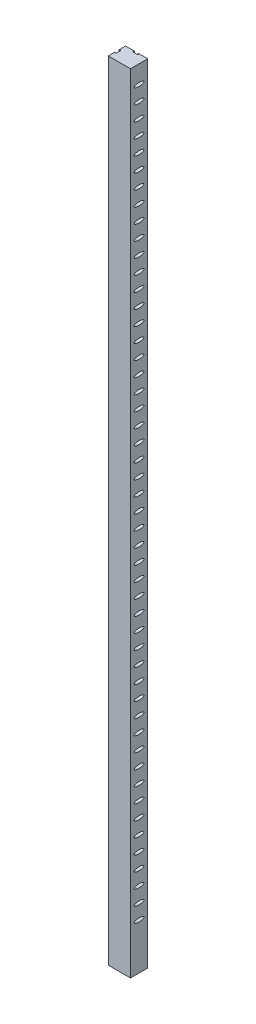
ISO-10303-21;
HEADER;
FILE_DESCRIPTION(('STEP AP214'),'2;1');
FILE_NAME('part.step','',(''),(''),'','','');
FILE_SCHEMA(('AUTOMOTIVE_DESIGN { 1 0 10303 214 1 1 1 1 }'));
ENDSEC;
DATA;
#1=APPLICATION_CONTEXT('core data for automotive mechanical design processes');
#2=APPLICATION_PROTOCOL_DEFINITION('international standard','automotive_design',2000,#1);
#3=PRODUCT_CONTEXT('',#1,'mechanical');
#4=PRODUCT('Part','Part','',(#3));
#5=PRODUCT_RELATED_PRODUCT_CATEGORY('part','',(#4));
#6=PRODUCT_DEFINITION_FORMATION('','',#4);
#7=PRODUCT_DEFINITION_CONTEXT('part definition',#1,'design');
#8=PRODUCT_DEFINITION('design','',#6,#7);
#9=PRODUCT_DEFINITION_SHAPE('','',#8);
#10=(LENGTH_UNIT() NAMED_UNIT(*) SI_UNIT(.MILLI.,.METRE.));
#11=(NAMED_UNIT(*) PLANE_ANGLE_UNIT() SI_UNIT($,.RADIAN.));
#12=(NAMED_UNIT(*) SI_UNIT($,.STERADIAN.) SOLID_ANGLE_UNIT());
#13=UNCERTAINTY_MEASURE_WITH_UNIT(LENGTH_MEASURE(1.E-05),#10,'distance_accuracy_value','');
#14=(GEOMETRIC_REPRESENTATION_CONTEXT(3) GLOBAL_UNCERTAINTY_ASSIGNED_CONTEXT((#13)) GLOBAL_UNIT_ASSIGNED_CONTEXT((#10,
#11,#12)) REPRESENTATION_CONTEXT('',''));
#15=CARTESIAN_POINT('',(0.,0.,0.));
#16=DIRECTION('',(0.,0.,1.));
#17=DIRECTION('',(1.,0.,0.));
#18=AXIS2_PLACEMENT_3D('',#15,#16,#17);
#19=CARTESIAN_POINT('',(4.,1600.,-17.5));
#20=DIRECTION('',(0.,0.,1.));
#21=DIRECTION('',(1.,0.,0.));
#22=AXIS2_PLACEMENT_3D('',#19,#20,#21);
#23=PLANE('',#22);
#24=DIRECTION('',(-1.,0.,0.));
#25=VECTOR('',#24,1.);
#26=CARTESIAN_POINT('',(4.,0.,-17.5));
#27=LINE('',#26,#25);
#28=CARTESIAN_POINT('',(22.5,0.,-17.5));
#29=VERTEX_POINT('',#28);
#30=CARTESIAN_POINT('',(4.,0.,-17.5));
#31=VERTEX_POINT('',#30);
#32=EDGE_CURVE('E226',#29,#31,#27,.T.);
#33=ORIENTED_EDGE('',*,*,#32,.T.);
#34=DIRECTION('',(0.,-1.,0.));
#35=VECTOR('',#34,1.);
#36=CARTESIAN_POINT('',(4.,1600.,-17.5));
#37=LINE('',#36,#35);
#38=CARTESIAN_POINT('',(4.,1600.,-17.5));
#39=VERTEX_POINT('',#38);
#40=EDGE_CURVE('E334',#39,#31,#37,.T.);
#41=ORIENTED_EDGE('',*,*,#40,.F.);
#42=DIRECTION('',(-1.,0.,0.));
#43=VECTOR('',#42,1.);
#44=CARTESIAN_POINT('',(4.,1600.,-17.5));
#45=LINE('',#44,#43);
#46=CARTESIAN_POINT('',(22.5,1600.,-17.5));
#47=VERTEX_POINT('',#46);
#48=EDGE_CURVE('E273',#47,#39,#45,.T.);
#49=ORIENTED_EDGE('',*,*,#48,.F.);
#50=DIRECTION('',(0.,-1.,0.));
#51=VECTOR('',#50,1.);
#52=CARTESIAN_POINT('',(22.5,1600.,-17.5));
#53=LINE('',#52,#51);
#54=EDGE_CURVE('E222',#47,#29,#53,.T.);
#55=ORIENTED_EDGE('',*,*,#54,.T.);
#56=EDGE_LOOP('',(#33,#41,#49,#55));
#57=FACE_BOUND('',#56,.T.);
#58=ADVANCED_FACE('F32',(#57),#23,.F.);
#59=CARTESIAN_POINT('',(4.,1600.,-16.5));
#60=DIRECTION('',(1.,0.,0.));
#61=DIRECTION('',(0.,0.,-1.));
#62=AXIS2_PLACEMENT_3D('',#59,#60,#61);
#63=PLANE('',#62);
#64=DIRECTION('',(0.,0.,1.));
#65=VECTOR('',#64,1.);
#66=CARTESIAN_POINT('',(4.,0.,-16.5));
#67=LINE('',#66,#65);
#68=CARTESIAN_POINT('',(4.,0.,-16.5));
#69=VERTEX_POINT('',#68);
#70=EDGE_CURVE('E229',#31,#69,#67,.T.);
#71=ORIENTED_EDGE('',*,*,#70,.T.);
#72=DIRECTION('',(0.,-1.,0.));
#73=VECTOR('',#72,1.);
#74=CARTESIAN_POINT('',(4.,1600.,-16.5));
#75=LINE('',#74,#73);
#76=CARTESIAN_POINT('',(4.,1600.,-16.5));
#77=VERTEX_POINT('',#76);
#78=EDGE_CURVE('E331',#77,#69,#75,.T.);
#79=ORIENTED_EDGE('',*,*,#78,.F.);
#80=DIRECTION('',(0.,0.,1.));
#81=VECTOR('',#80,1.);
#82=CARTESIAN_POINT('',(4.,1600.,-16.5));
#83=LINE('',#82,#81);
#84=EDGE_CURVE('E141',#39,#77,#83,.T.);
#85=ORIENTED_EDGE('',*,*,#84,.F.);
#86=ORIENTED_EDGE('',*,*,#40,.T.);
#87=EDGE_LOOP('',(#71,#79,#85,#86));
#88=FACE_BOUND('',#87,.T.);
#89=ADVANCED_FACE('F985',(#88),#63,.F.);
#90=CARTESIAN_POINT('',(5.,1600.,-16.5));
#91=DIRECTION('',(0.,0.,-1.));
#92=DIRECTION('',(-1.,0.,0.));
#93=AXIS2_PLACEMENT_3D('',#90,#91,#92);
#94=PLANE('',#93);
#95=DIRECTION('',(1.,0.,0.));
#96=VECTOR('',#95,1.);
#97=CARTESIAN_POINT('',(5.,0.,-16.5));
#98=LINE('',#97,#96);
#99=CARTESIAN_POINT('',(5.,0.,-16.5));
#100=VERTEX_POINT('',#99);
#101=EDGE_CURVE('E232',#69,#100,#98,.T.);
#102=ORIENTED_EDGE('',*,*,#101,.T.);
#103=DIRECTION('',(0.,-1.,0.));
#104=VECTOR('',#103,1.);
#105=CARTESIAN_POINT('',(5.,1600.,-16.5));
#106=LINE('',#105,#104);
#107=CARTESIAN_POINT('',(5.,1600.,-16.5));
#108=VERTEX_POINT('',#107);
#109=EDGE_CURVE('E328',#108,#100,#106,.T.);
#110=ORIENTED_EDGE('',*,*,#109,.F.);
#111=DIRECTION('',(1.,0.,0.));
#112=VECTOR('',#111,1.);
#113=CARTESIAN_POINT('',(5.,1600.,-16.5));
#114=LINE('',#113,#112);
#115=EDGE_CURVE('E1001',#77,#108,#114,.T.);
#116=ORIENTED_EDGE('',*,*,#115,.F.);
#117=ORIENTED_EDGE('',*,*,#78,.T.);
#118=EDGE_LOOP('',(#102,#110,#116,#117));
#119=FACE_BOUND('',#118,.T.);
#120=ADVANCED_FACE('F990',(#119),#94,.F.);
#121=CARTESIAN_POINT('',(5.,1600.,-15.4999999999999));
#122=DIRECTION('',(1.,0.,0.));
#123=DIRECTION('',(0.,0.,-1.));
#124=AXIS2_PLACEMENT_3D('',#121,#122,#123);
#125=PLANE('',#124);
#126=DIRECTION('',(0.,0.,1.));
#127=VECTOR('',#126,1.);
#128=CARTESIAN_POINT('',(5.,0.,-15.4999999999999));
#129=LINE('',#128,#127);
#130=CARTESIAN_POINT('',(5.,0.,-15.4999999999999));
#131=VERTEX_POINT('',#130);
#132=EDGE_CURVE('E234',#100,#131,#129,.T.);
#133=ORIENTED_EDGE('',*,*,#132,.T.);
#134=DIRECTION('',(0.,-1.,0.));
#135=VECTOR('',#134,1.);
#136=CARTESIAN_POINT('',(5.,1600.,-15.4999999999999));
#137=LINE('',#136,#135);
#138=CARTESIAN_POINT('',(5.,1600.,-15.4999999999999));
#139=VERTEX_POINT('',#138);
#140=EDGE_CURVE('E325',#139,#131,#137,.T.);
#141=ORIENTED_EDGE('',*,*,#140,.F.);
#142=DIRECTION('',(0.,0.,1.));
#143=VECTOR('',#142,1.);
#144=CARTESIAN_POINT('',(5.,1600.,-15.4999999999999));
#145=LINE('',#144,#143);
#146=EDGE_CURVE('E1003',#108,#139,#145,.T.);
#147=ORIENTED_EDGE('',*,*,#146,.F.);
#148=ORIENTED_EDGE('',*,*,#109,.T.);
#149=EDGE_LOOP('',(#133,#141,#147,#148));
#150=FACE_BOUND('',#149,.T.);
#151=ADVANCED_FACE('F1125',(#150),#125,.F.);
#152=CARTESIAN_POINT('',(4.,1600.,-14.5));
#153=DIRECTION('',(0.707106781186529,0.,0.707106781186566));
#154=DIRECTION('',(0.707106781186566,0.,-0.707106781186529));
#155=AXIS2_PLACEMENT_3D('',#152,#153,#154);
#156=PLANE('',#155);
#157=DIRECTION('',(-0.707106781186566,0.,0.707106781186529));
#158=VECTOR('',#157,1.);
#159=CARTESIAN_POINT('',(4.,0.,-14.5));
#160=LINE('',#159,#158);
#161=CARTESIAN_POINT('',(4.,0.,-14.5));
#162=VERTEX_POINT('',#161);
#163=EDGE_CURVE('E236',#131,#162,#160,.T.);
#164=ORIENTED_EDGE('',*,*,#163,.T.);
#165=DIRECTION('',(0.,-1.,0.));
#166=VECTOR('',#165,1.);
#167=CARTESIAN_POINT('',(4.,1600.,-14.5));
#168=LINE('',#167,#166);
#169=CARTESIAN_POINT('',(4.,1600.,-14.5));
#170=VERTEX_POINT('',#169);
#171=EDGE_CURVE('E322',#170,#162,#168,.T.);
#172=ORIENTED_EDGE('',*,*,#171,.F.);
#173=DIRECTION('',(-0.707106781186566,0.,0.707106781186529));
#174=VECTOR('',#173,1.);
#175=CARTESIAN_POINT('',(4.,1600.,-14.5));
#176=LINE('',#175,#174);
#177=EDGE_CURVE('E1005',#139,#170,#176,.T.);
#178=ORIENTED_EDGE('',*,*,#177,.F.);
#179=ORIENTED_EDGE('',*,*,#140,.T.);
#180=EDGE_LOOP('',(#164,#172,#178,#179));
#181=FACE_BOUND('',#180,.T.);
#182=ADVANCED_FACE('F1122',(#181),#156,.F.);
#183=CARTESIAN_POINT('',(-4.,1600.,-14.5));
#184=DIRECTION('',(0.,0.,1.));
#185=DIRECTION('',(1.,0.,0.));
#186=AXIS2_PLACEMENT_3D('',#183,#184,#185);
#187=PLANE('',#186);
#188=DIRECTION('',(-1.,0.,0.));
#189=VECTOR('',#188,1.);
#190=CARTESIAN_POINT('',(-4.,0.,-14.5));
#191=LINE('',#190,#189);
#192=CARTESIAN_POINT('',(-4.,0.,-14.5));
#193=VERTEX_POINT('',#192);
#194=EDGE_CURVE('E238',#162,#193,#191,.T.);
#195=ORIENTED_EDGE('',*,*,#194,.T.);
#196=DIRECTION('',(0.,-1.,0.));
#197=VECTOR('',#196,1.);
#198=CARTESIAN_POINT('',(-4.,1600.,-14.5));
#199=LINE('',#198,#197);
#200=CARTESIAN_POINT('',(-4.,1600.,-14.5));
#201=VERTEX_POINT('',#200);
#202=EDGE_CURVE('E319',#201,#193,#199,.T.);
#203=ORIENTED_EDGE('',*,*,#202,.F.);
#204=DIRECTION('',(-1.,0.,0.));
#205=VECTOR('',#204,1.);
#206=CARTESIAN_POINT('',(-4.,1600.,-14.5));
#207=LINE('',#206,#205);
#208=EDGE_CURVE('E1011',#170,#201,#207,.T.);
#209=ORIENTED_EDGE('',*,*,#208,.F.);
#210=ORIENTED_EDGE('',*,*,#171,.T.);
#211=EDGE_LOOP('',(#195,#203,#209,#210));
#212=FACE_BOUND('',#211,.T.);
#213=ADVANCED_FACE('F1118',(#212),#187,.F.);
#214=CARTESIAN_POINT('',(-5.,1600.,-15.5));
#215=DIRECTION('',(-0.707106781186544,0.,0.707106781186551));
#216=DIRECTION('',(0.707106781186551,0.,0.707106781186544));
#217=AXIS2_PLACEMENT_3D('',#214,#215,#216);
#218=PLANE('',#217);
#219=DIRECTION('',(-0.707106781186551,0.,-0.707106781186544));
#220=VECTOR('',#219,1.);
#221=CARTESIAN_POINT('',(-5.,0.,-15.5));
#222=LINE('',#221,#220);
#223=CARTESIAN_POINT('',(-5.,0.,-15.5));
#224=VERTEX_POINT('',#223);
#225=EDGE_CURVE('E240',#193,#224,#222,.T.);
#226=ORIENTED_EDGE('',*,*,#225,.T.);
#227=DIRECTION('',(0.,-1.,0.));
#228=VECTOR('',#227,1.);
#229=CARTESIAN_POINT('',(-5.,1600.,-15.5));
#230=LINE('',#229,#228);
#231=CARTESIAN_POINT('',(-5.,1600.,-15.5));
#232=VERTEX_POINT('',#231);
#233=EDGE_CURVE('E316',#232,#224,#230,.T.);
#234=ORIENTED_EDGE('',*,*,#233,.F.);
#235=DIRECTION('',(-0.707106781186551,0.,-0.707106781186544));
#236=VECTOR('',#235,1.);
#237=CARTESIAN_POINT('',(-5.,1600.,-15.5));
#238=LINE('',#237,#236);
#239=EDGE_CURVE('E1013',#201,#232,#238,.T.);
#240=ORIENTED_EDGE('',*,*,#239,.F.);
#241=ORIENTED_EDGE('',*,*,#202,.T.);
#242=EDGE_LOOP('',(#226,#234,#240,#241));
#243=FACE_BOUND('',#242,.T.);
#244=ADVANCED_FACE('F1113',(#243),#218,.F.);
#245=CARTESIAN_POINT('',(-5.,1600.,-16.5));
#246=DIRECTION('',(-1.,0.,0.));
#247=DIRECTION('',(0.,0.,1.));
#248=AXIS2_PLACEMENT_3D('',#245,#246,#247);
#249=PLANE('',#248);
#250=DIRECTION('',(0.,0.,-1.));
#251=VECTOR('',#250,1.);
#252=CARTESIAN_POINT('',(-5.,0.,-16.5));
#253=LINE('',#252,#251);
#254=CARTESIAN_POINT('',(-5.,0.,-16.5));
#255=VERTEX_POINT('',#254);
#256=EDGE_CURVE('E242',#224,#255,#253,.T.);
#257=ORIENTED_EDGE('',*,*,#256,.T.);
#258=DIRECTION('',(0.,-1.,0.));
#259=VECTOR('',#258,1.);
#260=CARTESIAN_POINT('',(-5.,1600.,-16.5));
#261=LINE('',#260,#259);
#262=CARTESIAN_POINT('',(-5.,1600.,-16.5));
#263=VERTEX_POINT('',#262);
#264=EDGE_CURVE('E313',#263,#255,#261,.T.);
#265=ORIENTED_EDGE('',*,*,#264,.F.);
#266=DIRECTION('',(0.,0.,-1.));
#267=VECTOR('',#266,1.);
#268=CARTESIAN_POINT('',(-5.,1600.,-16.5));
#269=LINE('',#268,#267);
#270=EDGE_CURVE('E1015',#232,#263,#269,.T.);
#271=ORIENTED_EDGE('',*,*,#270,.F.);
#272=ORIENTED_EDGE('',*,*,#233,.T.);
#273=EDGE_LOOP('',(#257,#265,#271,#272));
#274=FACE_BOUND('',#273,.T.);
#275=ADVANCED_FACE('F1107',(#274),#249,.F.);
#276=CARTESIAN_POINT('',(-4.,1600.,-16.5));
#277=DIRECTION('',(0.,0.,-1.));
#278=DIRECTION('',(-1.,0.,0.));
#279=AXIS2_PLACEMENT_3D('',#276,#277,#278);
#280=PLANE('',#279);
#281=DIRECTION('',(1.,0.,0.));
#282=VECTOR('',#281,1.);
#283=CARTESIAN_POINT('',(-4.,0.,-16.5));
#284=LINE('',#283,#282);
#285=CARTESIAN_POINT('',(-4.,0.,-16.5));
#286=VERTEX_POINT('',#285);
#287=EDGE_CURVE('E244',#255,#286,#284,.T.);
#288=ORIENTED_EDGE('',*,*,#287,.T.);
#289=DIRECTION('',(0.,-1.,0.));
#290=VECTOR('',#289,1.);
#291=CARTESIAN_POINT('',(-4.,1600.,-16.5));
#292=LINE('',#291,#290);
#293=CARTESIAN_POINT('',(-4.,1600.,-16.5));
#294=VERTEX_POINT('',#293);
#295=EDGE_CURVE('E310',#294,#286,#292,.T.);
#296=ORIENTED_EDGE('',*,*,#295,.F.);
#297=DIRECTION('',(1.,0.,0.));
#298=VECTOR('',#297,1.);
#299=CARTESIAN_POINT('',(-4.,1600.,-16.5));
#300=LINE('',#299,#298);
#301=EDGE_CURVE('E1017',#263,#294,#300,.T.);
#302=ORIENTED_EDGE('',*,*,#301,.F.);
#303=ORIENTED_EDGE('',*,*,#264,.T.);
#304=EDGE_LOOP('',(#288,#296,#302,#303));
#305=FACE_BOUND('',#304,.T.);
#306=ADVANCED_FACE('F1103',(#305),#280,.F.);
#307=CARTESIAN_POINT('',(-4.,1600.,-17.5));
#308=DIRECTION('',(-1.,0.,0.));
#309=DIRECTION('',(0.,0.,1.));
#310=AXIS2_PLACEMENT_3D('',#307,#308,#309);
#311=PLANE('',#310);
#312=DIRECTION('',(0.,0.,-1.));
#313=VECTOR('',#312,1.);
#314=CARTESIAN_POINT('',(-4.,0.,-17.5));
#315=LINE('',#314,#313);
#316=CARTESIAN_POINT('',(-4.,0.,-17.5));
#317=VERTEX_POINT('',#316);
#318=EDGE_CURVE('E246',#286,#317,#315,.T.);
#319=ORIENTED_EDGE('',*,*,#318,.T.);
#320=DIRECTION('',(0.,-1.,0.));
#321=VECTOR('',#320,1.);
#322=CARTESIAN_POINT('',(-4.,1600.,-17.5));
#323=LINE('',#322,#321);
#324=CARTESIAN_POINT('',(-4.,1600.,-17.5));
#325=VERTEX_POINT('',#324);
#326=EDGE_CURVE('E307',#325,#317,#323,.T.);
#327=ORIENTED_EDGE('',*,*,#326,.F.);
#328=DIRECTION('',(0.,0.,-1.));
#329=VECTOR('',#328,1.);
#330=CARTESIAN_POINT('',(-4.,1600.,-17.5));
#331=LINE('',#330,#329);
#332=EDGE_CURVE('E1019',#294,#325,#331,.T.);
#333=ORIENTED_EDGE('',*,*,#332,.F.);
#334=ORIENTED_EDGE('',*,*,#295,.T.);
#335=EDGE_LOOP('',(#319,#327,#333,#334));
#336=FACE_BOUND('',#335,.T.);
#337=ADVANCED_FACE('F1098',(#336),#311,.F.);
#338=CARTESIAN_POINT('',(-22.5,1600.,-17.5));
#339=DIRECTION('',(0.,0.,1.));
#340=DIRECTION('',(1.,0.,0.));
#341=AXIS2_PLACEMENT_3D('',#338,#339,#340);
#342=PLANE('',#341);
#343=DIRECTION('',(-1.,0.,0.));
#344=VECTOR('',#343,1.);
#345=CARTESIAN_POINT('',(-22.5,0.,-17.5));
#346=LINE('',#345,#344);
#347=CARTESIAN_POINT('',(-22.5,0.,-17.5));
#348=VERTEX_POINT('',#347);
#349=EDGE_CURVE('E248',#317,#348,#346,.T.);
#350=ORIENTED_EDGE('',*,*,#349,.T.);
#351=DIRECTION('',(0.,-1.,0.));
#352=VECTOR('',#351,1.);
#353=CARTESIAN_POINT('',(-22.5,1600.,-17.5));
#354=LINE('',#353,#352);
#355=CARTESIAN_POINT('',(-22.5,1600.,-17.5));
#356=VERTEX_POINT('',#355);
#357=EDGE_CURVE('E304',#356,#348,#354,.T.);
#358=ORIENTED_EDGE('',*,*,#357,.F.);
#359=DIRECTION('',(-1.,0.,0.));
#360=VECTOR('',#359,1.);
#361=CARTESIAN_POINT('',(-22.5,1600.,-17.5));
#362=LINE('',#361,#360);
#363=EDGE_CURVE('E1021',#325,#356,#362,.T.);
#364=ORIENTED_EDGE('',*,*,#363,.F.);
#365=ORIENTED_EDGE('',*,*,#326,.T.);
#366=EDGE_LOOP('',(#350,#358,#364,#365));
#367=FACE_BOUND('',#366,.T.);
#368=ADVANCED_FACE('F1092',(#367),#342,.F.);
#369=CARTESIAN_POINT('',(-22.5,1600.,-4.));
#370=DIRECTION('',(1.,0.,0.));
#371=DIRECTION('',(0.,0.,-1.));
#372=AXIS2_PLACEMENT_3D('',#369,#370,#371);
#373=PLANE('',#372);
#374=DIRECTION('',(0.,0.,1.));
#375=VECTOR('',#374,1.);
#376=CARTESIAN_POINT('',(-22.5,0.,-4.));
#377=LINE('',#376,#375);
#378=CARTESIAN_POINT('',(-22.5,0.,-4.));
#379=VERTEX_POINT('',#378);
#380=EDGE_CURVE('E250',#348,#379,#377,.T.);
#381=ORIENTED_EDGE('',*,*,#380,.T.);
#382=DIRECTION('',(0.,-1.,0.));
#383=VECTOR('',#382,1.);
#384=CARTESIAN_POINT('',(-22.5,1600.,-4.));
#385=LINE('',#384,#383);
#386=CARTESIAN_POINT('',(-22.5,1600.,-4.));
#387=VERTEX_POINT('',#386);
#388=EDGE_CURVE('E301',#387,#379,#385,.T.);
#389=ORIENTED_EDGE('',*,*,#388,.F.);
#390=DIRECTION('',(0.,0.,1.));
#391=VECTOR('',#390,1.);
#392=CARTESIAN_POINT('',(-22.5,1600.,-4.));
#393=LINE('',#392,#391);
#394=EDGE_CURVE('E1023',#356,#387,#393,.T.);
#395=ORIENTED_EDGE('',*,*,#394,.F.);
#396=ORIENTED_EDGE('',*,*,#357,.T.);
#397=EDGE_LOOP('',(#381,#389,#395,#396));
#398=FACE_BOUND('',#397,.T.);
#399=ADVANCED_FACE('F1088',(#398),#373,.F.);
#400=CARTESIAN_POINT('',(-22.5,1600.,-4.));
#401=DIRECTION('',(0.,0.,-1.));
#402=DIRECTION('',(-1.,0.,0.));
#403=AXIS2_PLACEMENT_3D('',#400,#401,#402);
#404=PLANE('',#403);
#405=DIRECTION('',(1.,0.,0.));
#406=VECTOR('',#405,1.);
#407=CARTESIAN_POINT('',(-22.5,0.,-4.));
#408=LINE('',#407,#406);
#409=CARTESIAN_POINT('',(-21.5,0.,-4.));
#410=VERTEX_POINT('',#409);
#411=EDGE_CURVE('E252',#379,#410,#408,.T.);
#412=ORIENTED_EDGE('',*,*,#411,.T.);
#413=DIRECTION('',(0.,-1.,0.));
#414=VECTOR('',#413,1.);
#415=CARTESIAN_POINT('',(-21.5,1600.,-4.));
#416=LINE('',#415,#414);
#417=CARTESIAN_POINT('',(-21.5,1600.,-4.));
#418=VERTEX_POINT('',#417);
#419=EDGE_CURVE('E298',#418,#410,#416,.T.);
#420=ORIENTED_EDGE('',*,*,#419,.F.);
#421=DIRECTION('',(1.,0.,0.));
#422=VECTOR('',#421,1.);
#423=CARTESIAN_POINT('',(-22.5,1600.,-4.));
#424=LINE('',#423,#422);
#425=EDGE_CURVE('E1025',#387,#418,#424,.T.);
#426=ORIENTED_EDGE('',*,*,#425,.F.);
#427=ORIENTED_EDGE('',*,*,#388,.T.);
#428=EDGE_LOOP('',(#412,#420,#426,#427));
#429=FACE_BOUND('',#428,.T.);
#430=ADVANCED_FACE('F1083',(#429),#404,.F.);
#431=CARTESIAN_POINT('',(-21.5,1600.,-4.));
#432=DIRECTION('',(-1.,0.,0.));
#433=DIRECTION('',(0.,0.,1.));
#434=AXIS2_PLACEMENT_3D('',#431,#432,#433);
#435=PLANE('',#434);
#436=DIRECTION('',(0.,0.,-1.));
#437=VECTOR('',#436,1.);
#438=CARTESIAN_POINT('',(-21.5,0.,-4.));
#439=LINE('',#438,#437);
#440=CARTESIAN_POINT('',(-21.5,0.,-5.));
#441=VERTEX_POINT('',#440);
#442=EDGE_CURVE('E254',#410,#441,#439,.T.);
#443=ORIENTED_EDGE('',*,*,#442,.T.);
#444=DIRECTION('',(0.,-1.,0.));
#445=VECTOR('',#444,1.);
#446=CARTESIAN_POINT('',(-21.5,1600.,-5.));
#447=LINE('',#446,#445);
#448=CARTESIAN_POINT('',(-21.5,1600.,-5.));
#449=VERTEX_POINT('',#448);
#450=EDGE_CURVE('E295',#449,#441,#447,.T.);
#451=ORIENTED_EDGE('',*,*,#450,.F.);
#452=DIRECTION('',(0.,0.,-1.));
#453=VECTOR('',#452,1.);
#454=CARTESIAN_POINT('',(-21.5,1600.,-4.));
#455=LINE('',#454,#453);
#456=EDGE_CURVE('E1027',#418,#449,#455,.T.);
#457=ORIENTED_EDGE('',*,*,#456,.F.);
#458=ORIENTED_EDGE('',*,*,#419,.T.);
#459=EDGE_LOOP('',(#443,#451,#457,#458));
#460=FACE_BOUND('',#459,.T.);
#461=ADVANCED_FACE('F1077',(#460),#435,.F.);
#462=CARTESIAN_POINT('',(-21.5,1600.,-5.));
#463=DIRECTION('',(0.,0.,-1.));
#464=DIRECTION('',(-1.,0.,0.));
#465=AXIS2_PLACEMENT_3D('',#462,#463,#464);
#466=PLANE('',#465);
#467=DIRECTION('',(1.,0.,0.));
#468=VECTOR('',#467,1.);
#469=CARTESIAN_POINT('',(-21.5,0.,-5.));
#470=LINE('',#469,#468);
#471=CARTESIAN_POINT('',(-20.5,0.,-5.));
#472=VERTEX_POINT('',#471);
#473=EDGE_CURVE('E256',#441,#472,#470,.T.);
#474=ORIENTED_EDGE('',*,*,#473,.T.);
#475=DIRECTION('',(0.,-1.,0.));
#476=VECTOR('',#475,1.);
#477=CARTESIAN_POINT('',(-20.5,1600.,-5.));
#478=LINE('',#477,#476);
#479=CARTESIAN_POINT('',(-20.5,1600.,-5.));
#480=VERTEX_POINT('',#479);
#481=EDGE_CURVE('E292',#480,#472,#478,.T.);
#482=ORIENTED_EDGE('',*,*,#481,.F.);
#483=DIRECTION('',(1.,0.,0.));
#484=VECTOR('',#483,1.);
#485=CARTESIAN_POINT('',(-21.5,1600.,-5.));
#486=LINE('',#485,#484);
#487=EDGE_CURVE('E1029',#449,#480,#486,.T.);
#488=ORIENTED_EDGE('',*,*,#487,.F.);
#489=ORIENTED_EDGE('',*,*,#450,.T.);
#490=EDGE_LOOP('',(#474,#482,#488,#489));
#491=FACE_BOUND('',#490,.T.);
#492=ADVANCED_FACE('F1073',(#491),#466,.F.);
#493=CARTESIAN_POINT('',(-20.5,1600.,-5.));
#494=DIRECTION('',(0.707106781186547,0.,-0.707106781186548));
#495=DIRECTION('',(-0.707106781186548,0.,-0.707106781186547));
#496=AXIS2_PLACEMENT_3D('',#493,#494,#495);
#497=PLANE('',#496);
#498=DIRECTION('',(0.707106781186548,0.,0.707106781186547));
#499=VECTOR('',#498,1.);
#500=CARTESIAN_POINT('',(-20.5,0.,-5.));
#501=LINE('',#500,#499);
#502=CARTESIAN_POINT('',(-19.5,0.,-4.));
#503=VERTEX_POINT('',#502);
#504=EDGE_CURVE('E258',#472,#503,#501,.T.);
#505=ORIENTED_EDGE('',*,*,#504,.T.);
#506=DIRECTION('',(0.,-1.,0.));
#507=VECTOR('',#506,1.);
#508=CARTESIAN_POINT('',(-19.5,1600.,-4.));
#509=LINE('',#508,#507);
#510=CARTESIAN_POINT('',(-19.5,1600.,-4.));
#511=VERTEX_POINT('',#510);
#512=EDGE_CURVE('E289',#511,#503,#509,.T.);
#513=ORIENTED_EDGE('',*,*,#512,.F.);
#514=DIRECTION('',(0.707106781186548,0.,0.707106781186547));
#515=VECTOR('',#514,1.);
#516=CARTESIAN_POINT('',(-20.5,1600.,-5.));
#517=LINE('',#516,#515);
#518=EDGE_CURVE('E1031',#480,#511,#517,.T.);
#519=ORIENTED_EDGE('',*,*,#518,.F.);
#520=ORIENTED_EDGE('',*,*,#481,.T.);
#521=EDGE_LOOP('',(#505,#513,#519,#520));
#522=FACE_BOUND('',#521,.T.);
#523=ADVANCED_FACE('F1068',(#522),#497,.F.);
#524=CARTESIAN_POINT('',(-19.5,1600.,-4.));
#525=DIRECTION('',(1.,0.,0.));
#526=DIRECTION('',(0.,0.,-1.));
#527=AXIS2_PLACEMENT_3D('',#524,#525,#526);
#528=PLANE('',#527);
#529=DIRECTION('',(0.,0.,1.));
#530=VECTOR('',#529,1.);
#531=CARTESIAN_POINT('',(-19.5,0.,-4.));
#532=LINE('',#531,#530);
#533=CARTESIAN_POINT('',(-19.5,0.,3.99999999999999));
#534=VERTEX_POINT('',#533);
#535=EDGE_CURVE('E260',#503,#534,#532,.T.);
#536=ORIENTED_EDGE('',*,*,#535,.T.);
#537=DIRECTION('',(0.,-1.,0.));
#538=VECTOR('',#537,1.);
#539=CARTESIAN_POINT('',(-19.5,1600.,3.99999999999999));
#540=LINE('',#539,#538);
#541=CARTESIAN_POINT('',(-19.5,1600.,3.99999999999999));
#542=VERTEX_POINT('',#541);
#543=EDGE_CURVE('E286',#542,#534,#540,.T.);
#544=ORIENTED_EDGE('',*,*,#543,.F.);
#545=DIRECTION('',(0.,0.,1.));
#546=VECTOR('',#545,1.);
#547=CARTESIAN_POINT('',(-19.5,1600.,-4.));
#548=LINE('',#547,#546);
#549=EDGE_CURVE('E1033',#511,#542,#548,.T.);
#550=ORIENTED_EDGE('',*,*,#549,.F.);
#551=ORIENTED_EDGE('',*,*,#512,.T.);
#552=EDGE_LOOP('',(#536,#544,#550,#551));
#553=FACE_BOUND('',#552,.T.);
#554=ADVANCED_FACE('F1062',(#553),#528,.F.);
#555=CARTESIAN_POINT('',(-19.5,1600.,3.99999999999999));
#556=DIRECTION('',(0.707106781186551,0.,0.707106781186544));
#557=DIRECTION('',(0.707106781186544,0.,-0.707106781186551));
#558=AXIS2_PLACEMENT_3D('',#555,#556,#557);
#559=PLANE('',#558);
#560=DIRECTION('',(-0.707106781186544,0.,0.70710678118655));
#561=VECTOR('',#560,1.);
#562=CARTESIAN_POINT('',(-19.5,0.,3.99999999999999));
#563=LINE('',#562,#561);
#564=CARTESIAN_POINT('',(-20.5,0.,5.));
#565=VERTEX_POINT('',#564);
#566=EDGE_CURVE('E262',#534,#565,#563,.T.);
#567=ORIENTED_EDGE('',*,*,#566,.T.);
#568=DIRECTION('',(0.,-1.,0.));
#569=VECTOR('',#568,1.);
#570=CARTESIAN_POINT('',(-20.5,1600.,5.));
#571=LINE('',#570,#569);
#572=CARTESIAN_POINT('',(-20.5,1600.,5.));
#573=VERTEX_POINT('',#572);
#574=EDGE_CURVE('E283',#573,#565,#571,.T.);
#575=ORIENTED_EDGE('',*,*,#574,.F.);
#576=DIRECTION('',(-0.707106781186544,0.,0.70710678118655));
#577=VECTOR('',#576,1.);
#578=CARTESIAN_POINT('',(-19.5,1600.,3.99999999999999));
#579=LINE('',#578,#577);
#580=EDGE_CURVE('E1035',#542,#573,#579,.T.);
#581=ORIENTED_EDGE('',*,*,#580,.F.);
#582=ORIENTED_EDGE('',*,*,#543,.T.);
#583=EDGE_LOOP('',(#567,#575,#581,#582));
#584=FACE_BOUND('',#583,.T.);
#585=ADVANCED_FACE('F1058',(#584),#559,.F.);
#586=CARTESIAN_POINT('',(-20.5,1600.,5.));
#587=DIRECTION('',(0.,0.,1.));
#588=DIRECTION('',(1.,0.,0.));
#589=AXIS2_PLACEMENT_3D('',#586,#587,#588);
#590=PLANE('',#589);
#591=DIRECTION('',(-1.,0.,0.));
#592=VECTOR('',#591,1.);
#593=CARTESIAN_POINT('',(-20.5,0.,5.));
#594=LINE('',#593,#592);
#595=CARTESIAN_POINT('',(-21.5,0.,5.));
#596=VERTEX_POINT('',#595);
#597=EDGE_CURVE('E264',#565,#596,#594,.T.);
#598=ORIENTED_EDGE('',*,*,#597,.T.);
#599=DIRECTION('',(0.,-1.,0.));
#600=VECTOR('',#599,1.);
#601=CARTESIAN_POINT('',(-21.5,1600.,5.));
#602=LINE('',#601,#600);
#603=CARTESIAN_POINT('',(-21.5,1600.,5.));
#604=VERTEX_POINT('',#603);
#605=EDGE_CURVE('E280',#604,#596,#602,.T.);
#606=ORIENTED_EDGE('',*,*,#605,.F.);
#607=DIRECTION('',(-1.,0.,0.));
#608=VECTOR('',#607,1.);
#609=CARTESIAN_POINT('',(-20.5,1600.,5.));
#610=LINE('',#609,#608);
#611=EDGE_CURVE('E1037',#573,#604,#610,.T.);
#612=ORIENTED_EDGE('',*,*,#611,.F.);
#613=ORIENTED_EDGE('',*,*,#574,.T.);
#614=EDGE_LOOP('',(#598,#606,#612,#613));
#615=FACE_BOUND('',#614,.T.);
#616=ADVANCED_FACE('F1054',(#615),#590,.F.);
#617=CARTESIAN_POINT('',(-21.5,1600.,5.));
#618=DIRECTION('',(-1.,0.,0.));
#619=DIRECTION('',(0.,0.,1.));
#620=AXIS2_PLACEMENT_3D('',#617,#618,#619);
#621=PLANE('',#620);
#622=DIRECTION('',(0.,0.,-1.));
#623=VECTOR('',#622,1.);
#624=CARTESIAN_POINT('',(-21.5,0.,5.));
#625=LINE('',#624,#623);
#626=CARTESIAN_POINT('',(-21.5,0.,4.));
#627=VERTEX_POINT('',#626);
#628=EDGE_CURVE('E266',#596,#627,#625,.T.);
#629=ORIENTED_EDGE('',*,*,#628,.T.);
#630=DIRECTION('',(0.,-1.,0.));
#631=VECTOR('',#630,1.);
#632=CARTESIAN_POINT('',(-21.5,1600.,4.));
#633=LINE('',#632,#631);
#634=CARTESIAN_POINT('',(-21.5,1600.,4.));
#635=VERTEX_POINT('',#634);
#636=EDGE_CURVE('E277',#635,#627,#633,.T.);
#637=ORIENTED_EDGE('',*,*,#636,.F.);
#638=DIRECTION('',(0.,0.,-1.));
#639=VECTOR('',#638,1.);
#640=CARTESIAN_POINT('',(-21.5,1600.,5.));
#641=LINE('',#640,#639);
#642=EDGE_CURVE('E1039',#604,#635,#641,.T.);
#643=ORIENTED_EDGE('',*,*,#642,.F.);
#644=ORIENTED_EDGE('',*,*,#605,.T.);
#645=EDGE_LOOP('',(#629,#637,#643,#644));
#646=FACE_BOUND('',#645,.T.);
#647=ADVANCED_FACE('F1045',(#646),#621,.F.);
#648=CARTESIAN_POINT('',(-21.5,1600.,4.));
#649=DIRECTION('',(0.,0.,1.));
#650=DIRECTION('',(1.,0.,0.));
#651=AXIS2_PLACEMENT_3D('',#648,#649,#650);
#652=PLANE('',#651);
#653=DIRECTION('',(-1.,0.,0.));
#654=VECTOR('',#653,1.);
#655=CARTESIAN_POINT('',(-21.5,0.,4.));
#656=LINE('',#655,#654);
#657=CARTESIAN_POINT('',(-22.5,0.,4.));
#658=VERTEX_POINT('',#657);
#659=EDGE_CURVE('E268',#627,#658,#656,.T.);
#660=ORIENTED_EDGE('',*,*,#659,.T.);
#661=DIRECTION('',(0.,-1.,0.));
#662=VECTOR('',#661,1.);
#663=CARTESIAN_POINT('',(-22.5,1600.,4.));
#664=LINE('',#663,#662);
#665=CARTESIAN_POINT('',(-22.5,1600.,4.));
#666=VERTEX_POINT('',#665);
#667=EDGE_CURVE('E217',#666,#658,#664,.T.);
#668=ORIENTED_EDGE('',*,*,#667,.F.);
#669=DIRECTION('',(-1.,0.,0.));
#670=VECTOR('',#669,1.);
#671=CARTESIAN_POINT('',(-21.5,1600.,4.));
#672=LINE('',#671,#670);
#673=EDGE_CURVE('E208',#635,#666,#672,.T.);
#674=ORIENTED_EDGE('',*,*,#673,.F.);
#675=ORIENTED_EDGE('',*,*,#636,.T.);
#676=EDGE_LOOP('',(#660,#668,#674,#675));
#677=FACE_BOUND('',#676,.T.);
#678=ADVANCED_FACE('F1049',(#677),#652,.F.);
#679=CARTESIAN_POINT('',(-22.5,1600.,4.));
#680=DIRECTION('',(1.,0.,0.));
#681=DIRECTION('',(0.,0.,-1.));
#682=AXIS2_PLACEMENT_3D('',#679,#680,#681);
#683=PLANE('',#682);
#684=DIRECTION('',(0.,0.,1.));
#685=VECTOR('',#684,1.);
#686=CARTESIAN_POINT('',(-22.5,0.,4.));
#687=LINE('',#686,#685);
#688=CARTESIAN_POINT('',(-22.5,0.,17.5));
#689=VERTEX_POINT('',#688);
#690=EDGE_CURVE('E216',#658,#689,#687,.T.);
#691=ORIENTED_EDGE('',*,*,#690,.T.);
#692=DIRECTION('',(0.,-1.,0.));
#693=VECTOR('',#692,1.);
#694=CARTESIAN_POINT('',(-22.5,1600.,17.5));
#695=LINE('',#694,#693);
#696=CARTESIAN_POINT('',(-22.5,1600.,17.5));
#697=VERTEX_POINT('',#696);
#698=EDGE_CURVE('E213',#697,#689,#695,.T.);
#699=ORIENTED_EDGE('',*,*,#698,.F.);
#700=DIRECTION('',(0.,0.,1.));
#701=VECTOR('',#700,1.);
#702=CARTESIAN_POINT('',(-22.5,1600.,4.));
#703=LINE('',#702,#701);
#704=EDGE_CURVE('E202',#666,#697,#703,.T.);
#705=ORIENTED_EDGE('',*,*,#704,.F.);
#706=ORIENTED_EDGE('',*,*,#667,.T.);
#707=EDGE_LOOP('',(#691,#699,#705,#706));
#708=FACE_BOUND('',#707,.T.);
#709=ADVANCED_FACE('F214',(#708),#683,.F.);
#710=CARTESIAN_POINT('',(-22.5,1600.,17.5));
#711=DIRECTION('',(0.,0.,-1.));
#712=DIRECTION('',(-1.,0.,0.));
#713=AXIS2_PLACEMENT_3D('',#710,#711,#712);
#714=PLANE('',#713);
#715=DIRECTION('',(1.,0.,0.));
#716=VECTOR('',#715,1.);
#717=CARTESIAN_POINT('',(-22.5,0.,17.5));
#718=LINE('',#717,#716);
#719=CARTESIAN_POINT('',(22.5,0.,17.5));
#720=VERTEX_POINT('',#719);
#721=EDGE_CURVE('E126',#689,#720,#718,.T.);
#722=ORIENTED_EDGE('',*,*,#721,.T.);
#723=DIRECTION('',(0.,-1.,0.));
#724=VECTOR('',#723,1.);
#725=CARTESIAN_POINT('',(22.5,1600.,17.5));
#726=LINE('',#725,#724);
#727=CARTESIAN_POINT('',(22.5,1600.,17.5));
#728=VERTEX_POINT('',#727);
#729=EDGE_CURVE('E218',#728,#720,#726,.T.);
#730=ORIENTED_EDGE('',*,*,#729,.F.);
#731=DIRECTION('',(1.,0.,0.));
#732=VECTOR('',#731,1.);
#733=CARTESIAN_POINT('',(-22.5,1600.,17.5));
#734=LINE('',#733,#732);
#735=EDGE_CURVE('E206',#697,#728,#734,.T.);
#736=ORIENTED_EDGE('',*,*,#735,.F.);
#737=ORIENTED_EDGE('',*,*,#698,.T.);
#738=EDGE_LOOP('',(#722,#730,#736,#737));
#739=FACE_BOUND('',#738,.T.);
#740=ADVANCED_FACE('F220',(#739),#714,.F.);
#741=CARTESIAN_POINT('',(22.5,1600.,17.5));
#742=DIRECTION('',(-1.,0.,0.));
#743=DIRECTION('',(0.,0.,1.));
#744=AXIS2_PLACEMENT_3D('',#741,#742,#743);
#745=PLANE('',#744);
#746=CARTESIAN_POINT('',(22.5,1533.5,0.));
#747=DIRECTION('',(1.,0.,0.));
#748=DIRECTION('',(0.,0.,-1.));
#749=AXIS2_PLACEMENT_3D('',#746,#747,#748);
#750=ELLIPSE('',#749,10.,3.50000000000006);
#751=CARTESIAN_POINT('',(22.5,1533.5,-10.));
#752=VERTEX_POINT('',#751);
#753=EDGE_CURVE('E1191',#752,#752,#750,.T.);
#754=ORIENTED_EDGE('',*,*,#753,.F.);
#755=EDGE_LOOP('',(#754));
#756=FACE_BOUND('',#755,.T.);
#757=CARTESIAN_POINT('',(22.5,1563.5,0.));
#758=DIRECTION('',(1.,0.,0.));
#759=DIRECTION('',(0.,0.,-1.));
#760=AXIS2_PLACEMENT_3D('',#757,#758,#759);
#761=ELLIPSE('',#760,10.,3.50000000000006);
#762=CARTESIAN_POINT('',(22.5,1563.5,-10.));
#763=VERTEX_POINT('',#762);
#764=EDGE_CURVE('E1190',#763,#763,#761,.T.);
#765=ORIENTED_EDGE('',*,*,#764,.F.);
#766=EDGE_LOOP('',(#765));
#767=FACE_BOUND('',#766,.T.);
#768=DIRECTION('',(0.,0.,-1.));
#769=VECTOR('',#768,1.);
#770=CARTESIAN_POINT('',(22.5,0.,17.5));
#771=LINE('',#770,#769);
#772=EDGE_CURVE('E132',#720,#29,#771,.T.);
#773=ORIENTED_EDGE('',*,*,#772,.T.);
#774=ORIENTED_EDGE('',*,*,#54,.F.);
#775=DIRECTION('',(0.,0.,-1.));
#776=VECTOR('',#775,1.);
#777=CARTESIAN_POINT('',(22.5,1600.,17.5));
#778=LINE('',#777,#776);
#779=EDGE_CURVE('E49',#728,#47,#778,.T.);
#780=ORIENTED_EDGE('',*,*,#779,.F.);
#781=ORIENTED_EDGE('',*,*,#729,.T.);
#782=EDGE_LOOP('',(#773,#774,#780,#781));
#783=FACE_BOUND('',#782,.T.);
#784=CARTESIAN_POINT('',(22.5,1503.5,0.));
#785=DIRECTION('',(1.,0.,0.));
#786=DIRECTION('',(0.,0.,-1.));
#787=AXIS2_PLACEMENT_3D('',#784,#785,#786);
#788=ELLIPSE('',#787,10.,3.50000000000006);
#789=CARTESIAN_POINT('',(22.5,1503.5,-10.));
#790=VERTEX_POINT('',#789);
#791=EDGE_CURVE('E336',#790,#790,#788,.T.);
#792=ORIENTED_EDGE('',*,*,#791,.F.);
#793=EDGE_LOOP('',(#792));
#794=FACE_BOUND('',#793,.T.);
#795=CARTESIAN_POINT('',(22.5,1473.5,0.));
#796=DIRECTION('',(1.,0.,0.));
#797=DIRECTION('',(0.,0.,-1.));
#798=AXIS2_PLACEMENT_3D('',#795,#796,#797);
#799=ELLIPSE('',#798,10.,3.50000000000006);
#800=CARTESIAN_POINT('',(22.5,1473.5,-10.));
#801=VERTEX_POINT('',#800);
#802=EDGE_CURVE('E341',#801,#801,#799,.T.);
#803=ORIENTED_EDGE('',*,*,#802,.F.);
#804=EDGE_LOOP('',(#803));
#805=FACE_BOUND('',#804,.T.);
#806=CARTESIAN_POINT('',(22.5,1443.5,0.));
#807=DIRECTION('',(1.,0.,0.));
#808=DIRECTION('',(0.,0.,-1.));
#809=AXIS2_PLACEMENT_3D('',#806,#807,#808);
#810=ELLIPSE('',#809,10.,3.50000000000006);
#811=CARTESIAN_POINT('',(22.5,1443.5,-10.));
#812=VERTEX_POINT('',#811);
#813=EDGE_CURVE('E367',#812,#812,#810,.T.);
#814=ORIENTED_EDGE('',*,*,#813,.F.);
#815=EDGE_LOOP('',(#814));
#816=FACE_BOUND('',#815,.T.);
#817=CARTESIAN_POINT('',(22.5,1413.5,0.));
#818=DIRECTION('',(1.,0.,0.));
#819=DIRECTION('',(0.,0.,-1.));
#820=AXIS2_PLACEMENT_3D('',#817,#818,#819);
#821=ELLIPSE('',#820,10.,3.50000000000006);
#822=CARTESIAN_POINT('',(22.5,1413.5,-10.));
#823=VERTEX_POINT('',#822);
#824=EDGE_CURVE('E374',#823,#823,#821,.T.);
#825=ORIENTED_EDGE('',*,*,#824,.F.);
#826=EDGE_LOOP('',(#825));
#827=FACE_BOUND('',#826,.T.);
#828=CARTESIAN_POINT('',(22.5,1383.5,0.));
#829=DIRECTION('',(1.,0.,0.));
#830=DIRECTION('',(0.,0.,-1.));
#831=AXIS2_PLACEMENT_3D('',#828,#829,#830);
#832=ELLIPSE('',#831,10.,3.50000000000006);
#833=CARTESIAN_POINT('',(22.5,1383.5,-10.));
#834=VERTEX_POINT('',#833);
#835=EDGE_CURVE('E394',#834,#834,#832,.T.);
#836=ORIENTED_EDGE('',*,*,#835,.F.);
#837=EDGE_LOOP('',(#836));
#838=FACE_BOUND('',#837,.T.);
#839=CARTESIAN_POINT('',(22.5,1353.5,0.));
#840=DIRECTION('',(1.,0.,0.));
#841=DIRECTION('',(0.,0.,-1.));
#842=AXIS2_PLACEMENT_3D('',#839,#840,#841);
#843=ELLIPSE('',#842,10.,3.50000000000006);
#844=CARTESIAN_POINT('',(22.5,1353.5,-10.));
#845=VERTEX_POINT('',#844);
#846=EDGE_CURVE('E401',#845,#845,#843,.T.);
#847=ORIENTED_EDGE('',*,*,#846,.F.);
#848=EDGE_LOOP('',(#847));
#849=FACE_BOUND('',#848,.T.);
#850=CARTESIAN_POINT('',(22.5,1323.5,0.));
#851=DIRECTION('',(1.,0.,0.));
#852=DIRECTION('',(0.,0.,-1.));
#853=AXIS2_PLACEMENT_3D('',#850,#851,#852);
#854=ELLIPSE('',#853,10.,3.50000000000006);
#855=CARTESIAN_POINT('',(22.5,1323.5,-10.));
#856=VERTEX_POINT('',#855);
#857=EDGE_CURVE('E421',#856,#856,#854,.T.);
#858=ORIENTED_EDGE('',*,*,#857,.F.);
#859=EDGE_LOOP('',(#858));
#860=FACE_BOUND('',#859,.T.);
#861=CARTESIAN_POINT('',(22.5,1293.5,0.));
#862=DIRECTION('',(1.,0.,0.));
#863=DIRECTION('',(0.,0.,-1.));
#864=AXIS2_PLACEMENT_3D('',#861,#862,#863);
#865=ELLIPSE('',#864,10.,3.50000000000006);
#866=CARTESIAN_POINT('',(22.5,1293.5,-10.));
#867=VERTEX_POINT('',#866);
#868=EDGE_CURVE('E428',#867,#867,#865,.T.);
#869=ORIENTED_EDGE('',*,*,#868,.F.);
#870=EDGE_LOOP('',(#869));
#871=FACE_BOUND('',#870,.T.);
#872=CARTESIAN_POINT('',(22.5,1263.5,0.));
#873=DIRECTION('',(1.,0.,0.));
#874=DIRECTION('',(0.,0.,-1.));
#875=AXIS2_PLACEMENT_3D('',#872,#873,#874);
#876=ELLIPSE('',#875,10.,3.50000000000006);
#877=CARTESIAN_POINT('',(22.5,1263.5,-10.));
#878=VERTEX_POINT('',#877);
#879=EDGE_CURVE('E448',#878,#878,#876,.T.);
#880=ORIENTED_EDGE('',*,*,#879,.F.);
#881=EDGE_LOOP('',(#880));
#882=FACE_BOUND('',#881,.T.);
#883=CARTESIAN_POINT('',(22.5,1233.5,0.));
#884=DIRECTION('',(1.,0.,0.));
#885=DIRECTION('',(0.,0.,-1.));
#886=AXIS2_PLACEMENT_3D('',#883,#884,#885);
#887=ELLIPSE('',#886,10.,3.50000000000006);
#888=CARTESIAN_POINT('',(22.5,1233.5,-10.));
#889=VERTEX_POINT('',#888);
#890=EDGE_CURVE('E455',#889,#889,#887,.T.);
#891=ORIENTED_EDGE('',*,*,#890,.F.);
#892=EDGE_LOOP('',(#891));
#893=FACE_BOUND('',#892,.T.);
#894=CARTESIAN_POINT('',(22.5,1203.5,0.));
#895=DIRECTION('',(1.,0.,0.));
#896=DIRECTION('',(0.,0.,-1.));
#897=AXIS2_PLACEMENT_3D('',#894,#895,#896);
#898=ELLIPSE('',#897,10.,3.50000000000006);
#899=CARTESIAN_POINT('',(22.5,1203.5,-10.));
#900=VERTEX_POINT('',#899);
#901=EDGE_CURVE('E475',#900,#900,#898,.T.);
#902=ORIENTED_EDGE('',*,*,#901,.F.);
#903=EDGE_LOOP('',(#902));
#904=FACE_BOUND('',#903,.T.);
#905=CARTESIAN_POINT('',(22.5,1173.5,0.));
#906=DIRECTION('',(1.,0.,0.));
#907=DIRECTION('',(0.,0.,-1.));
#908=AXIS2_PLACEMENT_3D('',#905,#906,#907);
#909=ELLIPSE('',#908,10.,3.50000000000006);
#910=CARTESIAN_POINT('',(22.5,1173.5,-10.));
#911=VERTEX_POINT('',#910);
#912=EDGE_CURVE('E482',#911,#911,#909,.T.);
#913=ORIENTED_EDGE('',*,*,#912,.F.);
#914=EDGE_LOOP('',(#913));
#915=FACE_BOUND('',#914,.T.);
#916=CARTESIAN_POINT('',(22.5,1143.5,0.));
#917=DIRECTION('',(1.,0.,0.));
#918=DIRECTION('',(0.,0.,-1.));
#919=AXIS2_PLACEMENT_3D('',#916,#917,#918);
#920=ELLIPSE('',#919,10.,3.50000000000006);
#921=CARTESIAN_POINT('',(22.5,1143.5,-10.));
#922=VERTEX_POINT('',#921);
#923=EDGE_CURVE('E502',#922,#922,#920,.T.);
#924=ORIENTED_EDGE('',*,*,#923,.F.);
#925=EDGE_LOOP('',(#924));
#926=FACE_BOUND('',#925,.T.);
#927=CARTESIAN_POINT('',(22.5,1113.5,0.));
#928=DIRECTION('',(1.,0.,0.));
#929=DIRECTION('',(0.,0.,-1.));
#930=AXIS2_PLACEMENT_3D('',#927,#928,#929);
#931=ELLIPSE('',#930,10.,3.50000000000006);
#932=CARTESIAN_POINT('',(22.5,1113.5,-10.));
#933=VERTEX_POINT('',#932);
#934=EDGE_CURVE('E509',#933,#933,#931,.T.);
#935=ORIENTED_EDGE('',*,*,#934,.F.);
#936=EDGE_LOOP('',(#935));
#937=FACE_BOUND('',#936,.T.);
#938=CARTESIAN_POINT('',(22.5,1083.5,0.));
#939=DIRECTION('',(1.,0.,0.));
#940=DIRECTION('',(0.,0.,-1.));
#941=AXIS2_PLACEMENT_3D('',#938,#939,#940);
#942=ELLIPSE('',#941,10.,3.50000000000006);
#943=CARTESIAN_POINT('',(22.5,1083.5,-10.));
#944=VERTEX_POINT('',#943);
#945=EDGE_CURVE('E529',#944,#944,#942,.T.);
#946=ORIENTED_EDGE('',*,*,#945,.F.);
#947=EDGE_LOOP('',(#946));
#948=FACE_BOUND('',#947,.T.);
#949=CARTESIAN_POINT('',(22.5,1053.5,0.));
#950=DIRECTION('',(1.,0.,0.));
#951=DIRECTION('',(0.,0.,-1.));
#952=AXIS2_PLACEMENT_3D('',#949,#950,#951);
#953=ELLIPSE('',#952,10.,3.50000000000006);
#954=CARTESIAN_POINT('',(22.5,1053.5,-10.));
#955=VERTEX_POINT('',#954);
#956=EDGE_CURVE('E536',#955,#955,#953,.T.);
#957=ORIENTED_EDGE('',*,*,#956,.F.);
#958=EDGE_LOOP('',(#957));
#959=FACE_BOUND('',#958,.T.);
#960=CARTESIAN_POINT('',(22.5,1023.5,0.));
#961=DIRECTION('',(1.,0.,0.));
#962=DIRECTION('',(0.,0.,-1.));
#963=AXIS2_PLACEMENT_3D('',#960,#961,#962);
#964=ELLIPSE('',#963,10.,3.50000000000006);
#965=CARTESIAN_POINT('',(22.5,1023.5,-10.));
#966=VERTEX_POINT('',#965);
#967=EDGE_CURVE('E556',#966,#966,#964,.T.);
#968=ORIENTED_EDGE('',*,*,#967,.F.);
#969=EDGE_LOOP('',(#968));
#970=FACE_BOUND('',#969,.T.);
#971=CARTESIAN_POINT('',(22.5,993.5,0.));
#972=DIRECTION('',(1.,0.,0.));
#973=DIRECTION('',(0.,0.,-1.));
#974=AXIS2_PLACEMENT_3D('',#971,#972,#973);
#975=ELLIPSE('',#974,10.,3.50000000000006);
#976=CARTESIAN_POINT('',(22.5,993.5,-10.));
#977=VERTEX_POINT('',#976);
#978=EDGE_CURVE('E563',#977,#977,#975,.T.);
#979=ORIENTED_EDGE('',*,*,#978,.F.);
#980=EDGE_LOOP('',(#979));
#981=FACE_BOUND('',#980,.T.);
#982=CARTESIAN_POINT('',(22.5,963.5,0.));
#983=DIRECTION('',(1.,0.,0.));
#984=DIRECTION('',(0.,0.,-1.));
#985=AXIS2_PLACEMENT_3D('',#982,#983,#984);
#986=ELLIPSE('',#985,10.,3.50000000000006);
#987=CARTESIAN_POINT('',(22.5,963.5,-10.));
#988=VERTEX_POINT('',#987);
#989=EDGE_CURVE('E583',#988,#988,#986,.T.);
#990=ORIENTED_EDGE('',*,*,#989,.F.);
#991=EDGE_LOOP('',(#990));
#992=FACE_BOUND('',#991,.T.);
#993=CARTESIAN_POINT('',(22.5,933.5,0.));
#994=DIRECTION('',(1.,0.,0.));
#995=DIRECTION('',(0.,0.,-1.));
#996=AXIS2_PLACEMENT_3D('',#993,#994,#995);
#997=ELLIPSE('',#996,10.,3.50000000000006);
#998=CARTESIAN_POINT('',(22.5,933.5,-10.));
#999=VERTEX_POINT('',#998);
#1000=EDGE_CURVE('E590',#999,#999,#997,.T.);
#1001=ORIENTED_EDGE('',*,*,#1000,.F.);
#1002=EDGE_LOOP('',(#1001));
#1003=FACE_BOUND('',#1002,.T.);
#1004=CARTESIAN_POINT('',(22.5,903.5,0.));
#1005=DIRECTION('',(1.,0.,0.));
#1006=DIRECTION('',(0.,0.,-1.));
#1007=AXIS2_PLACEMENT_3D('',#1004,#1005,#1006);
#1008=ELLIPSE('',#1007,10.,3.50000000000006);
#1009=CARTESIAN_POINT('',(22.5,903.5,-10.));
#1010=VERTEX_POINT('',#1009);
#1011=EDGE_CURVE('E610',#1010,#1010,#1008,.T.);
#1012=ORIENTED_EDGE('',*,*,#1011,.F.);
#1013=EDGE_LOOP('',(#1012));
#1014=FACE_BOUND('',#1013,.T.);
#1015=CARTESIAN_POINT('',(22.5,873.5,0.));
#1016=DIRECTION('',(1.,0.,0.));
#1017=DIRECTION('',(0.,0.,-1.));
#1018=AXIS2_PLACEMENT_3D('',#1015,#1016,#1017);
#1019=ELLIPSE('',#1018,10.,3.50000000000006);
#1020=CARTESIAN_POINT('',(22.5,873.5,-10.));
#1021=VERTEX_POINT('',#1020);
#1022=EDGE_CURVE('E617',#1021,#1021,#1019,.T.);
#1023=ORIENTED_EDGE('',*,*,#1022,.F.);
#1024=EDGE_LOOP('',(#1023));
#1025=FACE_BOUND('',#1024,.T.);
#1026=CARTESIAN_POINT('',(22.5,843.5,0.));
#1027=DIRECTION('',(1.,0.,0.));
#1028=DIRECTION('',(0.,0.,-1.));
#1029=AXIS2_PLACEMENT_3D('',#1026,#1027,#1028);
#1030=ELLIPSE('',#1029,10.,3.50000000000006);
#1031=CARTESIAN_POINT('',(22.5,843.5,-10.));
#1032=VERTEX_POINT('',#1031);
#1033=EDGE_CURVE('E637',#1032,#1032,#1030,.T.);
#1034=ORIENTED_EDGE('',*,*,#1033,.F.);
#1035=EDGE_LOOP('',(#1034));
#1036=FACE_BOUND('',#1035,.T.);
#1037=CARTESIAN_POINT('',(22.5,813.5,0.));
#1038=DIRECTION('',(1.,0.,0.));
#1039=DIRECTION('',(0.,0.,-1.));
#1040=AXIS2_PLACEMENT_3D('',#1037,#1038,#1039);
#1041=ELLIPSE('',#1040,10.,3.50000000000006);
#1042=CARTESIAN_POINT('',(22.5,813.5,-10.));
#1043=VERTEX_POINT('',#1042);
#1044=EDGE_CURVE('E644',#1043,#1043,#1041,.T.);
#1045=ORIENTED_EDGE('',*,*,#1044,.F.);
#1046=EDGE_LOOP('',(#1045));
#1047=FACE_BOUND('',#1046,.T.);
#1048=CARTESIAN_POINT('',(22.5,783.5,0.));
#1049=DIRECTION('',(1.,0.,0.));
#1050=DIRECTION('',(0.,0.,-1.));
#1051=AXIS2_PLACEMENT_3D('',#1048,#1049,#1050);
#1052=ELLIPSE('',#1051,10.,3.50000000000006);
#1053=CARTESIAN_POINT('',(22.5,783.5,-10.));
#1054=VERTEX_POINT('',#1053);
#1055=EDGE_CURVE('E664',#1054,#1054,#1052,.T.);
#1056=ORIENTED_EDGE('',*,*,#1055,.F.);
#1057=EDGE_LOOP('',(#1056));
#1058=FACE_BOUND('',#1057,.T.);
#1059=CARTESIAN_POINT('',(22.5,753.5,0.));
#1060=DIRECTION('',(1.,0.,0.));
#1061=DIRECTION('',(0.,0.,-1.));
#1062=AXIS2_PLACEMENT_3D('',#1059,#1060,#1061);
#1063=ELLIPSE('',#1062,10.,3.50000000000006);
#1064=CARTESIAN_POINT('',(22.5,753.5,-10.));
#1065=VERTEX_POINT('',#1064);
#1066=EDGE_CURVE('E671',#1065,#1065,#1063,.T.);
#1067=ORIENTED_EDGE('',*,*,#1066,.F.);
#1068=EDGE_LOOP('',(#1067));
#1069=FACE_BOUND('',#1068,.T.);
#1070=CARTESIAN_POINT('',(22.5,723.5,0.));
#1071=DIRECTION('',(1.,0.,0.));
#1072=DIRECTION('',(0.,0.,-1.));
#1073=AXIS2_PLACEMENT_3D('',#1070,#1071,#1072);
#1074=ELLIPSE('',#1073,10.,3.50000000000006);
#1075=CARTESIAN_POINT('',(22.5,723.5,-10.));
#1076=VERTEX_POINT('',#1075);
#1077=EDGE_CURVE('E691',#1076,#1076,#1074,.T.);
#1078=ORIENTED_EDGE('',*,*,#1077,.F.);
#1079=EDGE_LOOP('',(#1078));
#1080=FACE_BOUND('',#1079,.T.);
#1081=CARTESIAN_POINT('',(22.5,693.5,0.));
#1082=DIRECTION('',(1.,0.,0.));
#1083=DIRECTION('',(0.,0.,-1.));
#1084=AXIS2_PLACEMENT_3D('',#1081,#1082,#1083);
#1085=ELLIPSE('',#1084,10.,3.50000000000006);
#1086=CARTESIAN_POINT('',(22.5,693.5,-10.));
#1087=VERTEX_POINT('',#1086);
#1088=EDGE_CURVE('E698',#1087,#1087,#1085,.T.);
#1089=ORIENTED_EDGE('',*,*,#1088,.F.);
#1090=EDGE_LOOP('',(#1089));
#1091=FACE_BOUND('',#1090,.T.);
#1092=CARTESIAN_POINT('',(22.5,663.5,0.));
#1093=DIRECTION('',(1.,0.,0.));
#1094=DIRECTION('',(0.,0.,-1.));
#1095=AXIS2_PLACEMENT_3D('',#1092,#1093,#1094);
#1096=ELLIPSE('',#1095,10.,3.50000000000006);
#1097=CARTESIAN_POINT('',(22.5,663.5,-10.));
#1098=VERTEX_POINT('',#1097);
#1099=EDGE_CURVE('E718',#1098,#1098,#1096,.T.);
#1100=ORIENTED_EDGE('',*,*,#1099,.F.);
#1101=EDGE_LOOP('',(#1100));
#1102=FACE_BOUND('',#1101,.T.);
#1103=CARTESIAN_POINT('',(22.5,633.5,0.));
#1104=DIRECTION('',(1.,0.,0.));
#1105=DIRECTION('',(0.,0.,-1.));
#1106=AXIS2_PLACEMENT_3D('',#1103,#1104,#1105);
#1107=ELLIPSE('',#1106,10.,3.50000000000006);
#1108=CARTESIAN_POINT('',(22.5,633.5,-10.));
#1109=VERTEX_POINT('',#1108);
#1110=EDGE_CURVE('E725',#1109,#1109,#1107,.T.);
#1111=ORIENTED_EDGE('',*,*,#1110,.F.);
#1112=EDGE_LOOP('',(#1111));
#1113=FACE_BOUND('',#1112,.T.);
#1114=CARTESIAN_POINT('',(22.5,603.5,0.));
#1115=DIRECTION('',(1.,0.,0.));
#1116=DIRECTION('',(0.,0.,-1.));
#1117=AXIS2_PLACEMENT_3D('',#1114,#1115,#1116);
#1118=ELLIPSE('',#1117,10.,3.50000000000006);
#1119=CARTESIAN_POINT('',(22.5,603.5,-10.));
#1120=VERTEX_POINT('',#1119);
#1121=EDGE_CURVE('E745',#1120,#1120,#1118,.T.);
#1122=ORIENTED_EDGE('',*,*,#1121,.F.);
#1123=EDGE_LOOP('',(#1122));
#1124=FACE_BOUND('',#1123,.T.);
#1125=CARTESIAN_POINT('',(22.5,573.5,0.));
#1126=DIRECTION('',(1.,0.,0.));
#1127=DIRECTION('',(0.,0.,-1.));
#1128=AXIS2_PLACEMENT_3D('',#1125,#1126,#1127);
#1129=ELLIPSE('',#1128,10.,3.50000000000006);
#1130=CARTESIAN_POINT('',(22.5,573.5,-10.));
#1131=VERTEX_POINT('',#1130);
#1132=EDGE_CURVE('E752',#1131,#1131,#1129,.T.);
#1133=ORIENTED_EDGE('',*,*,#1132,.F.);
#1134=EDGE_LOOP('',(#1133));
#1135=FACE_BOUND('',#1134,.T.);
#1136=CARTESIAN_POINT('',(22.5,543.5,0.));
#1137=DIRECTION('',(1.,0.,0.));
#1138=DIRECTION('',(0.,0.,-1.));
#1139=AXIS2_PLACEMENT_3D('',#1136,#1137,#1138);
#1140=ELLIPSE('',#1139,10.,3.50000000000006);
#1141=CARTESIAN_POINT('',(22.5,543.5,-10.));
#1142=VERTEX_POINT('',#1141);
#1143=EDGE_CURVE('E772',#1142,#1142,#1140,.T.);
#1144=ORIENTED_EDGE('',*,*,#1143,.F.);
#1145=EDGE_LOOP('',(#1144));
#1146=FACE_BOUND('',#1145,.T.);
#1147=CARTESIAN_POINT('',(22.5,513.5,0.));
#1148=DIRECTION('',(1.,0.,0.));
#1149=DIRECTION('',(0.,0.,-1.));
#1150=AXIS2_PLACEMENT_3D('',#1147,#1148,#1149);
#1151=ELLIPSE('',#1150,10.,3.50000000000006);
#1152=CARTESIAN_POINT('',(22.5,513.5,-10.));
#1153=VERTEX_POINT('',#1152);
#1154=EDGE_CURVE('E779',#1153,#1153,#1151,.T.);
#1155=ORIENTED_EDGE('',*,*,#1154,.F.);
#1156=EDGE_LOOP('',(#1155));
#1157=FACE_BOUND('',#1156,.T.);
#1158=CARTESIAN_POINT('',(22.5,483.5,0.));
#1159=DIRECTION('',(1.,0.,0.));
#1160=DIRECTION('',(0.,0.,-1.));
#1161=AXIS2_PLACEMENT_3D('',#1158,#1159,#1160);
#1162=ELLIPSE('',#1161,10.,3.50000000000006);
#1163=CARTESIAN_POINT('',(22.5,483.5,-10.));
#1164=VERTEX_POINT('',#1163);
#1165=EDGE_CURVE('E799',#1164,#1164,#1162,.T.);
#1166=ORIENTED_EDGE('',*,*,#1165,.F.);
#1167=EDGE_LOOP('',(#1166));
#1168=FACE_BOUND('',#1167,.T.);
#1169=CARTESIAN_POINT('',(22.5,453.5,0.));
#1170=DIRECTION('',(1.,0.,0.));
#1171=DIRECTION('',(0.,0.,-1.));
#1172=AXIS2_PLACEMENT_3D('',#1169,#1170,#1171);
#1173=ELLIPSE('',#1172,10.,3.50000000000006);
#1174=CARTESIAN_POINT('',(22.5,453.5,-10.));
#1175=VERTEX_POINT('',#1174);
#1176=EDGE_CURVE('E806',#1175,#1175,#1173,.T.);
#1177=ORIENTED_EDGE('',*,*,#1176,.F.);
#1178=EDGE_LOOP('',(#1177));
#1179=FACE_BOUND('',#1178,.T.);
#1180=CARTESIAN_POINT('',(22.5,423.5,0.));
#1181=DIRECTION('',(1.,0.,0.));
#1182=DIRECTION('',(0.,0.,-1.));
#1183=AXIS2_PLACEMENT_3D('',#1180,#1181,#1182);
#1184=ELLIPSE('',#1183,10.,3.50000000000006);
#1185=CARTESIAN_POINT('',(22.5,423.5,-10.));
#1186=VERTEX_POINT('',#1185);
#1187=EDGE_CURVE('E826',#1186,#1186,#1184,.T.);
#1188=ORIENTED_EDGE('',*,*,#1187,.F.);
#1189=EDGE_LOOP('',(#1188));
#1190=FACE_BOUND('',#1189,.T.);
#1191=CARTESIAN_POINT('',(22.5,393.5,0.));
#1192=DIRECTION('',(1.,0.,0.));
#1193=DIRECTION('',(0.,0.,-1.));
#1194=AXIS2_PLACEMENT_3D('',#1191,#1192,#1193);
#1195=ELLIPSE('',#1194,10.,3.50000000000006);
#1196=CARTESIAN_POINT('',(22.5,393.5,-10.));
#1197=VERTEX_POINT('',#1196);
#1198=EDGE_CURVE('E833',#1197,#1197,#1195,.T.);
#1199=ORIENTED_EDGE('',*,*,#1198,.F.);
#1200=EDGE_LOOP('',(#1199));
#1201=FACE_BOUND('',#1200,.T.);
#1202=CARTESIAN_POINT('',(22.5,363.5,0.));
#1203=DIRECTION('',(1.,0.,0.));
#1204=DIRECTION('',(0.,0.,-1.));
#1205=AXIS2_PLACEMENT_3D('',#1202,#1203,#1204);
#1206=ELLIPSE('',#1205,10.,3.50000000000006);
#1207=CARTESIAN_POINT('',(22.5,363.5,-10.));
#1208=VERTEX_POINT('',#1207);
#1209=EDGE_CURVE('E853',#1208,#1208,#1206,.T.);
#1210=ORIENTED_EDGE('',*,*,#1209,.F.);
#1211=EDGE_LOOP('',(#1210));
#1212=FACE_BOUND('',#1211,.T.);
#1213=CARTESIAN_POINT('',(22.5,333.5,0.));
#1214=DIRECTION('',(1.,0.,0.));
#1215=DIRECTION('',(0.,0.,-1.));
#1216=AXIS2_PLACEMENT_3D('',#1213,#1214,#1215);
#1217=ELLIPSE('',#1216,10.,3.50000000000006);
#1218=CARTESIAN_POINT('',(22.5,333.5,-10.));
#1219=VERTEX_POINT('',#1218);
#1220=EDGE_CURVE('E860',#1219,#1219,#1217,.T.);
#1221=ORIENTED_EDGE('',*,*,#1220,.F.);
#1222=EDGE_LOOP('',(#1221));
#1223=FACE_BOUND('',#1222,.T.);
#1224=CARTESIAN_POINT('',(22.5,303.5,0.));
#1225=DIRECTION('',(1.,0.,0.));
#1226=DIRECTION('',(0.,0.,-1.));
#1227=AXIS2_PLACEMENT_3D('',#1224,#1225,#1226);
#1228=ELLIPSE('',#1227,10.,3.50000000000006);
#1229=CARTESIAN_POINT('',(22.5,303.5,-10.));
#1230=VERTEX_POINT('',#1229);
#1231=EDGE_CURVE('E880',#1230,#1230,#1228,.T.);
#1232=ORIENTED_EDGE('',*,*,#1231,.F.);
#1233=EDGE_LOOP('',(#1232));
#1234=FACE_BOUND('',#1233,.T.);
#1235=CARTESIAN_POINT('',(22.5,273.5,0.));
#1236=DIRECTION('',(1.,0.,0.));
#1237=DIRECTION('',(0.,0.,-1.));
#1238=AXIS2_PLACEMENT_3D('',#1235,#1236,#1237);
#1239=ELLIPSE('',#1238,10.,3.50000000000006);
#1240=CARTESIAN_POINT('',(22.5,273.5,-10.));
#1241=VERTEX_POINT('',#1240);
#1242=EDGE_CURVE('E887',#1241,#1241,#1239,.T.);
#1243=ORIENTED_EDGE('',*,*,#1242,.F.);
#1244=EDGE_LOOP('',(#1243));
#1245=FACE_BOUND('',#1244,.T.);
#1246=CARTESIAN_POINT('',(22.5,243.5,0.));
#1247=DIRECTION('',(1.,0.,0.));
#1248=DIRECTION('',(0.,0.,-1.));
#1249=AXIS2_PLACEMENT_3D('',#1246,#1247,#1248);
#1250=ELLIPSE('',#1249,10.,3.50000000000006);
#1251=CARTESIAN_POINT('',(22.5,243.5,-10.));
#1252=VERTEX_POINT('',#1251);
#1253=EDGE_CURVE('E907',#1252,#1252,#1250,.T.);
#1254=ORIENTED_EDGE('',*,*,#1253,.F.);
#1255=EDGE_LOOP('',(#1254));
#1256=FACE_BOUND('',#1255,.T.);
#1257=CARTESIAN_POINT('',(22.5,213.5,0.));
#1258=DIRECTION('',(1.,0.,0.));
#1259=DIRECTION('',(0.,0.,-1.));
#1260=AXIS2_PLACEMENT_3D('',#1257,#1258,#1259);
#1261=ELLIPSE('',#1260,10.,3.50000000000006);
#1262=CARTESIAN_POINT('',(22.5,213.5,-10.));
#1263=VERTEX_POINT('',#1262);
#1264=EDGE_CURVE('E914',#1263,#1263,#1261,.T.);
#1265=ORIENTED_EDGE('',*,*,#1264,.F.);
#1266=EDGE_LOOP('',(#1265));
#1267=FACE_BOUND('',#1266,.T.);
#1268=CARTESIAN_POINT('',(22.5,183.5,0.));
#1269=DIRECTION('',(1.,0.,0.));
#1270=DIRECTION('',(0.,0.,-1.));
#1271=AXIS2_PLACEMENT_3D('',#1268,#1269,#1270);
#1272=ELLIPSE('',#1271,10.,3.50000000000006);
#1273=CARTESIAN_POINT('',(22.5,183.5,-10.));
#1274=VERTEX_POINT('',#1273);
#1275=EDGE_CURVE('E934',#1274,#1274,#1272,.T.);
#1276=ORIENTED_EDGE('',*,*,#1275,.F.);
#1277=EDGE_LOOP('',(#1276));
#1278=FACE_BOUND('',#1277,.T.);
#1279=CARTESIAN_POINT('',(22.5,153.5,0.));
#1280=DIRECTION('',(1.,0.,0.));
#1281=DIRECTION('',(0.,0.,-1.));
#1282=AXIS2_PLACEMENT_3D('',#1279,#1280,#1281);
#1283=ELLIPSE('',#1282,10.,3.50000000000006);
#1284=CARTESIAN_POINT('',(22.5,153.5,-10.));
#1285=VERTEX_POINT('',#1284);
#1286=EDGE_CURVE('E941',#1285,#1285,#1283,.T.);
#1287=ORIENTED_EDGE('',*,*,#1286,.F.);
#1288=EDGE_LOOP('',(#1287));
#1289=FACE_BOUND('',#1288,.T.);
#1290=CARTESIAN_POINT('',(22.5,123.5,0.));
#1291=DIRECTION('',(1.,0.,0.));
#1292=DIRECTION('',(0.,0.,-1.));
#1293=AXIS2_PLACEMENT_3D('',#1290,#1291,#1292);
#1294=ELLIPSE('',#1293,10.,3.50000000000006);
#1295=CARTESIAN_POINT('',(22.5,123.5,-10.));
#1296=VERTEX_POINT('',#1295);
#1297=EDGE_CURVE('E961',#1296,#1296,#1294,.T.);
#1298=ORIENTED_EDGE('',*,*,#1297,.F.);
#1299=EDGE_LOOP('',(#1298));
#1300=FACE_BOUND('',#1299,.T.);
#1301=CARTESIAN_POINT('',(22.5,93.5000000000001,0.));
#1302=DIRECTION('',(1.,0.,0.));
#1303=DIRECTION('',(0.,0.,-1.));
#1304=AXIS2_PLACEMENT_3D('',#1301,#1302,#1303);
#1305=ELLIPSE('',#1304,10.,3.50000000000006);
#1306=CARTESIAN_POINT('',(22.5,93.5000000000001,-10.));
#1307=VERTEX_POINT('',#1306);
#1308=EDGE_CURVE('E36',#1307,#1307,#1305,.T.);
#1309=ORIENTED_EDGE('',*,*,#1308,.F.);
#1310=EDGE_LOOP('',(#1309));
#1311=FACE_BOUND('',#1310,.T.);
#1312=ADVANCED_FACE('F1171',(#756,#767,#783,#794,#805,#816,#827,#838,#849,#860,#871,#882,#893,
#904,#915,#926,#937,#948,#959,#970,#981,#992,#1003,#1014,#1025,#1036,#1047,#1058,#1069,#1080,
#1091,#1102,#1113,#1124,#1135,#1146,#1157,#1168,#1179,#1190,#1201,#1212,#1223,#1234,#1245,#1256,
#1267,#1278,#1289,#1300,#1311),#745,.F.);
#1313=CARTESIAN_POINT('',(22.5,1600.,-17.5));
#1314=DIRECTION('',(0.,1.,0.));
#1315=DIRECTION('',(0.,0.,1.));
#1316=AXIS2_PLACEMENT_3D('',#1313,#1314,#1315);
#1317=PLANE('',#1316);
#1318=ORIENTED_EDGE('',*,*,#48,.T.);
#1319=ORIENTED_EDGE('',*,*,#84,.T.);
#1320=ORIENTED_EDGE('',*,*,#115,.T.);
#1321=ORIENTED_EDGE('',*,*,#146,.T.);
#1322=ORIENTED_EDGE('',*,*,#177,.T.);
#1323=ORIENTED_EDGE('',*,*,#208,.T.);
#1324=ORIENTED_EDGE('',*,*,#239,.T.);
#1325=ORIENTED_EDGE('',*,*,#270,.T.);
#1326=ORIENTED_EDGE('',*,*,#301,.T.);
#1327=ORIENTED_EDGE('',*,*,#332,.T.);
#1328=ORIENTED_EDGE('',*,*,#363,.T.);
#1329=ORIENTED_EDGE('',*,*,#394,.T.);
#1330=ORIENTED_EDGE('',*,*,#425,.T.);
#1331=ORIENTED_EDGE('',*,*,#456,.T.);
#1332=ORIENTED_EDGE('',*,*,#487,.T.);
#1333=ORIENTED_EDGE('',*,*,#518,.T.);
#1334=ORIENTED_EDGE('',*,*,#549,.T.);
#1335=ORIENTED_EDGE('',*,*,#580,.T.);
#1336=ORIENTED_EDGE('',*,*,#611,.T.);
#1337=ORIENTED_EDGE('',*,*,#642,.T.);
#1338=ORIENTED_EDGE('',*,*,#673,.T.);
#1339=ORIENTED_EDGE('',*,*,#704,.T.);
#1340=ORIENTED_EDGE('',*,*,#735,.T.);
#1341=ORIENTED_EDGE('',*,*,#779,.T.);
#1342=EDGE_LOOP('',(#1318,#1319,#1320,#1321,#1322,#1323,#1324,#1325,#1326,#1327,#1328,#1329,
#1330,#1331,#1332,#1333,#1334,#1335,#1336,#1337,#1338,#1339,#1340,#1341));
#1343=FACE_BOUND('',#1342,.T.);
#1344=ADVANCED_FACE('F204',(#1343),#1317,.T.);
#1345=CARTESIAN_POINT('',(22.5,0.,-17.5));
#1346=DIRECTION('',(0.,1.,0.));
#1347=DIRECTION('',(0.,0.,1.));
#1348=AXIS2_PLACEMENT_3D('',#1345,#1346,#1347);
#1349=PLANE('',#1348);
#1350=ORIENTED_EDGE('',*,*,#32,.F.);
#1351=ORIENTED_EDGE('',*,*,#772,.F.);
#1352=ORIENTED_EDGE('',*,*,#721,.F.);
#1353=ORIENTED_EDGE('',*,*,#690,.F.);
#1354=ORIENTED_EDGE('',*,*,#659,.F.);
#1355=ORIENTED_EDGE('',*,*,#628,.F.);
#1356=ORIENTED_EDGE('',*,*,#597,.F.);
#1357=ORIENTED_EDGE('',*,*,#566,.F.);
#1358=ORIENTED_EDGE('',*,*,#535,.F.);
#1359=ORIENTED_EDGE('',*,*,#504,.F.);
#1360=ORIENTED_EDGE('',*,*,#473,.F.);
#1361=ORIENTED_EDGE('',*,*,#442,.F.);
#1362=ORIENTED_EDGE('',*,*,#411,.F.);
#1363=ORIENTED_EDGE('',*,*,#380,.F.);
#1364=ORIENTED_EDGE('',*,*,#349,.F.);
#1365=ORIENTED_EDGE('',*,*,#318,.F.);
#1366=ORIENTED_EDGE('',*,*,#287,.F.);
#1367=ORIENTED_EDGE('',*,*,#256,.F.);
#1368=ORIENTED_EDGE('',*,*,#225,.F.);
#1369=ORIENTED_EDGE('',*,*,#194,.F.);
#1370=ORIENTED_EDGE('',*,*,#163,.F.);
#1371=ORIENTED_EDGE('',*,*,#132,.F.);
#1372=ORIENTED_EDGE('',*,*,#101,.F.);
#1373=ORIENTED_EDGE('',*,*,#70,.F.);
#1374=EDGE_LOOP('',(#1350,#1351,#1352,#1353,#1354,#1355,#1356,#1357,#1358,#1359,#1360,#1361,
#1362,#1363,#1364,#1365,#1366,#1367,#1368,#1369,#1370,#1371,#1372,#1373));
#1375=FACE_BOUND('',#1374,.T.);
#1376=ADVANCED_FACE('F995',(#1375),#1349,.F.);
#1377=CARTESIAN_POINT('',(12.5,1563.5,0.));
#1378=DIRECTION('',(1.,0.,0.));
#1379=DIRECTION('',(0.,0.,-1.));
#1380=AXIS2_PLACEMENT_3D('',#1377,#1378,#1379);
#1381=ELLIPSE('',#1380,10.,3.50000000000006);
#1382=DIRECTION('',(1.,0.,0.));
#1383=VECTOR('',#1382,1.);
#1384=SURFACE_OF_LINEAR_EXTRUSION('',#1381,#1383);
#1385=CARTESIAN_POINT('',(12.5,1563.5,-10.));
#1386=VERTEX_POINT('',#1385);
#1387=EDGE_CURVE('E230',#1386,#1386,#1381,.T.);
#1388=ORIENTED_EDGE('',*,*,#1387,.F.);
#1389=EDGE_LOOP('',(#1388));
#1390=FACE_BOUND('',#1389,.T.);
#1391=ORIENTED_EDGE('',*,*,#764,.T.);
#1392=EDGE_LOOP('',(#1391));
#1393=FACE_BOUND('',#1392,.T.);
#1394=ADVANCED_FACE('F1177',(#1390,#1393),#1384,.F.);
#1395=CARTESIAN_POINT('',(12.5,1563.5,0.));
#1396=DIRECTION('',(1.,0.,0.));
#1397=DIRECTION('',(0.,0.,-1.));
#1398=AXIS2_PLACEMENT_3D('',#1395,#1396,#1397);
#1399=PLANE('',#1398);
#1400=ORIENTED_EDGE('',*,*,#1387,.T.);
#1401=EDGE_LOOP('',(#1400));
#1402=FACE_BOUND('',#1401,.T.);
#1403=ADVANCED_FACE('F1183',(#1402),#1399,.T.);
#1404=CARTESIAN_POINT('',(12.5,1533.5,0.));
#1405=DIRECTION('',(1.,0.,0.));
#1406=DIRECTION('',(0.,0.,-1.));
#1407=AXIS2_PLACEMENT_3D('',#1404,#1405,#1406);
#1408=ELLIPSE('',#1407,10.,3.50000000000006);
#1409=DIRECTION('',(1.,0.,0.));
#1410=VECTOR('',#1409,1.);
#1411=SURFACE_OF_LINEAR_EXTRUSION('',#1408,#1410);
#1412=CARTESIAN_POINT('',(12.5,1533.5,-10.));
#1413=VERTEX_POINT('',#1412);
#1414=EDGE_CURVE('E1194',#1413,#1413,#1408,.T.);
#1415=ORIENTED_EDGE('',*,*,#1414,.F.);
#1416=EDGE_LOOP('',(#1415));
#1417=FACE_BOUND('',#1416,.T.);
#1418=ORIENTED_EDGE('',*,*,#753,.T.);
#1419=EDGE_LOOP('',(#1418));
#1420=FACE_BOUND('',#1419,.T.);
#1421=ADVANCED_FACE('F356',(#1417,#1420),#1411,.F.);
#1422=CARTESIAN_POINT('',(12.5,1533.5,0.));
#1423=DIRECTION('',(1.,0.,0.));
#1424=DIRECTION('',(0.,0.,-1.));
#1425=AXIS2_PLACEMENT_3D('',#1422,#1423,#1424);
#1426=PLANE('',#1425);
#1427=ORIENTED_EDGE('',*,*,#1414,.T.);
#1428=EDGE_LOOP('',(#1427));
#1429=FACE_BOUND('',#1428,.T.);
#1430=ADVANCED_FACE('F354',(#1429),#1426,.T.);
#1431=CARTESIAN_POINT('',(12.5,1503.5,0.));
#1432=DIRECTION('',(1.,0.,0.));
#1433=DIRECTION('',(0.,0.,-1.));
#1434=AXIS2_PLACEMENT_3D('',#1431,#1432,#1433);
#1435=PLANE('',#1434);
#1436=CARTESIAN_POINT('',(12.5,1503.5,0.));
#1437=DIRECTION('',(1.,0.,0.));
#1438=DIRECTION('',(0.,0.,-1.));
#1439=AXIS2_PLACEMENT_3D('',#1436,#1437,#1438);
#1440=ELLIPSE('',#1439,10.,3.50000000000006);
#1441=CARTESIAN_POINT('',(12.5,1503.5,-10.));
#1442=VERTEX_POINT('',#1441);
#1443=EDGE_CURVE('E337',#1442,#1442,#1440,.T.);
#1444=ORIENTED_EDGE('',*,*,#1443,.T.);
#1445=EDGE_LOOP('',(#1444));
#1446=FACE_BOUND('',#1445,.T.);
#1447=ADVANCED_FACE('F349',(#1446),#1435,.T.);
#1448=DIRECTION('',(1.,0.,0.));
#1449=VECTOR('',#1448,1.);
#1450=SURFACE_OF_LINEAR_EXTRUSION('',#1440,#1449);
#1451=ORIENTED_EDGE('',*,*,#1443,.F.);
#1452=EDGE_LOOP('',(#1451));
#1453=FACE_BOUND('',#1452,.T.);
#1454=ORIENTED_EDGE('',*,*,#791,.T.);
#1455=EDGE_LOOP('',(#1454));
#1456=FACE_BOUND('',#1455,.T.);
#1457=ADVANCED_FACE('F344',(#1453,#1456),#1450,.F.);
#1458=CARTESIAN_POINT('',(12.5,1473.5,0.));
#1459=DIRECTION('',(1.,0.,0.));
#1460=DIRECTION('',(0.,0.,-1.));
#1461=AXIS2_PLACEMENT_3D('',#1458,#1459,#1460);
#1462=PLANE('',#1461);
#1463=CARTESIAN_POINT('',(12.5,1473.5,0.));
#1464=DIRECTION('',(1.,0.,0.));
#1465=DIRECTION('',(0.,0.,-1.));
#1466=AXIS2_PLACEMENT_3D('',#1463,#1464,#1465);
#1467=ELLIPSE('',#1466,10.,3.50000000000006);
#1468=CARTESIAN_POINT('',(12.5,1473.5,-10.));
#1469=VERTEX_POINT('',#1468);
#1470=EDGE_CURVE('E363',#1469,#1469,#1467,.T.);
#1471=ORIENTED_EDGE('',*,*,#1470,.T.);
#1472=EDGE_LOOP('',(#1471));
#1473=FACE_BOUND('',#1472,.T.);
#1474=ADVANCED_FACE('F348',(#1473),#1462,.T.);
#1475=DIRECTION('',(1.,0.,0.));
#1476=VECTOR('',#1475,1.);
#1477=SURFACE_OF_LINEAR_EXTRUSION('',#1467,#1476);
#1478=ORIENTED_EDGE('',*,*,#1470,.F.);
#1479=EDGE_LOOP('',(#1478));
#1480=FACE_BOUND('',#1479,.T.);
#1481=ORIENTED_EDGE('',*,*,#802,.T.);
#1482=EDGE_LOOP('',(#1481));
#1483=FACE_BOUND('',#1482,.T.);
#1484=ADVANCED_FACE('F357',(#1480,#1483),#1477,.F.);
#1485=CARTESIAN_POINT('',(12.5,1443.5,0.));
#1486=DIRECTION('',(1.,0.,0.));
#1487=DIRECTION('',(0.,0.,-1.));
#1488=AXIS2_PLACEMENT_3D('',#1485,#1486,#1487);
#1489=PLANE('',#1488);
#1490=CARTESIAN_POINT('',(12.5,1443.5,0.));
#1491=DIRECTION('',(1.,0.,0.));
#1492=DIRECTION('',(0.,0.,-1.));
#1493=AXIS2_PLACEMENT_3D('',#1490,#1491,#1492);
#1494=ELLIPSE('',#1493,10.,3.50000000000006);
#1495=CARTESIAN_POINT('',(12.5,1443.5,-10.));
#1496=VERTEX_POINT('',#1495);
#1497=EDGE_CURVE('E370',#1496,#1496,#1494,.T.);
#1498=ORIENTED_EDGE('',*,*,#1497,.T.);
#1499=EDGE_LOOP('',(#1498));
#1500=FACE_BOUND('',#1499,.T.);
#1501=ADVANCED_FACE('F360',(#1500),#1489,.T.);
#1502=DIRECTION('',(1.,0.,0.));
#1503=VECTOR('',#1502,1.);
#1504=SURFACE_OF_LINEAR_EXTRUSION('',#1494,#1503);
#1505=ORIENTED_EDGE('',*,*,#1497,.F.);
#1506=EDGE_LOOP('',(#1505));
#1507=FACE_BOUND('',#1506,.T.);
#1508=ORIENTED_EDGE('',*,*,#813,.T.);
#1509=EDGE_LOOP('',(#1508));
#1510=FACE_BOUND('',#1509,.T.);
#1511=ADVANCED_FACE('F376',(#1507,#1510),#1504,.F.);
#1512=CARTESIAN_POINT('',(12.5,1413.5,0.));
#1513=DIRECTION('',(1.,0.,0.));
#1514=DIRECTION('',(0.,0.,-1.));
#1515=AXIS2_PLACEMENT_3D('',#1512,#1513,#1514);
#1516=PLANE('',#1515);
#1517=CARTESIAN_POINT('',(12.5,1413.5,0.));
#1518=DIRECTION('',(1.,0.,0.));
#1519=DIRECTION('',(0.,0.,-1.));
#1520=AXIS2_PLACEMENT_3D('',#1517,#1518,#1519);
#1521=ELLIPSE('',#1520,10.,3.50000000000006);
#1522=CARTESIAN_POINT('',(12.5,1413.5,-10.));
#1523=VERTEX_POINT('',#1522);
#1524=EDGE_CURVE('E390',#1523,#1523,#1521,.T.);
#1525=ORIENTED_EDGE('',*,*,#1524,.T.);
#1526=EDGE_LOOP('',(#1525));
#1527=FACE_BOUND('',#1526,.T.);
#1528=ADVANCED_FACE('F379',(#1527),#1516,.T.);
#1529=DIRECTION('',(1.,0.,0.));
#1530=VECTOR('',#1529,1.);
#1531=SURFACE_OF_LINEAR_EXTRUSION('',#1521,#1530);
#1532=ORIENTED_EDGE('',*,*,#1524,.F.);
#1533=EDGE_LOOP('',(#1532));
#1534=FACE_BOUND('',#1533,.T.);
#1535=ORIENTED_EDGE('',*,*,#824,.T.);
#1536=EDGE_LOOP('',(#1535));
#1537=FACE_BOUND('',#1536,.T.);
#1538=ADVANCED_FACE('F384',(#1534,#1537),#1531,.F.);
#1539=CARTESIAN_POINT('',(12.5,1383.5,0.));
#1540=DIRECTION('',(1.,0.,0.));
#1541=DIRECTION('',(0.,0.,-1.));
#1542=AXIS2_PLACEMENT_3D('',#1539,#1540,#1541);
#1543=PLANE('',#1542);
#1544=CARTESIAN_POINT('',(12.5,1383.5,0.));
#1545=DIRECTION('',(1.,0.,0.));
#1546=DIRECTION('',(0.,0.,-1.));
#1547=AXIS2_PLACEMENT_3D('',#1544,#1545,#1546);
#1548=ELLIPSE('',#1547,10.,3.50000000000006);
#1549=CARTESIAN_POINT('',(12.5,1383.5,-10.));
#1550=VERTEX_POINT('',#1549);
#1551=EDGE_CURVE('E397',#1550,#1550,#1548,.T.);
#1552=ORIENTED_EDGE('',*,*,#1551,.T.);
#1553=EDGE_LOOP('',(#1552));
#1554=FACE_BOUND('',#1553,.T.);
#1555=ADVANCED_FACE('F387',(#1554),#1543,.T.);
#1556=DIRECTION('',(1.,0.,0.));
#1557=VECTOR('',#1556,1.);
#1558=SURFACE_OF_LINEAR_EXTRUSION('',#1548,#1557);
#1559=ORIENTED_EDGE('',*,*,#1551,.F.);
#1560=EDGE_LOOP('',(#1559));
#1561=FACE_BOUND('',#1560,.T.);
#1562=ORIENTED_EDGE('',*,*,#835,.T.);
#1563=EDGE_LOOP('',(#1562));
#1564=FACE_BOUND('',#1563,.T.);
#1565=ADVANCED_FACE('F403',(#1561,#1564),#1558,.F.);
#1566=CARTESIAN_POINT('',(12.5,1353.5,0.));
#1567=DIRECTION('',(1.,0.,0.));
#1568=DIRECTION('',(0.,0.,-1.));
#1569=AXIS2_PLACEMENT_3D('',#1566,#1567,#1568);
#1570=PLANE('',#1569);
#1571=CARTESIAN_POINT('',(12.5,1353.5,0.));
#1572=DIRECTION('',(1.,0.,0.));
#1573=DIRECTION('',(0.,0.,-1.));
#1574=AXIS2_PLACEMENT_3D('',#1571,#1572,#1573);
#1575=ELLIPSE('',#1574,10.,3.50000000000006);
#1576=CARTESIAN_POINT('',(12.5,1353.5,-10.));
#1577=VERTEX_POINT('',#1576);
#1578=EDGE_CURVE('E417',#1577,#1577,#1575,.T.);
#1579=ORIENTED_EDGE('',*,*,#1578,.T.);
#1580=EDGE_LOOP('',(#1579));
#1581=FACE_BOUND('',#1580,.T.);
#1582=ADVANCED_FACE('F406',(#1581),#1570,.T.);
#1583=DIRECTION('',(1.,0.,0.));
#1584=VECTOR('',#1583,1.);
#1585=SURFACE_OF_LINEAR_EXTRUSION('',#1575,#1584);
#1586=ORIENTED_EDGE('',*,*,#1578,.F.);
#1587=EDGE_LOOP('',(#1586));
#1588=FACE_BOUND('',#1587,.T.);
#1589=ORIENTED_EDGE('',*,*,#846,.T.);
#1590=EDGE_LOOP('',(#1589));
#1591=FACE_BOUND('',#1590,.T.);
#1592=ADVANCED_FACE('F411',(#1588,#1591),#1585,.F.);
#1593=CARTESIAN_POINT('',(12.5,1323.5,0.));
#1594=DIRECTION('',(1.,0.,0.));
#1595=DIRECTION('',(0.,0.,-1.));
#1596=AXIS2_PLACEMENT_3D('',#1593,#1594,#1595);
#1597=PLANE('',#1596);
#1598=CARTESIAN_POINT('',(12.5,1323.5,0.));
#1599=DIRECTION('',(1.,0.,0.));
#1600=DIRECTION('',(0.,0.,-1.));
#1601=AXIS2_PLACEMENT_3D('',#1598,#1599,#1600);
#1602=ELLIPSE('',#1601,10.,3.50000000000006);
#1603=CARTESIAN_POINT('',(12.5,1323.5,-10.));
#1604=VERTEX_POINT('',#1603);
#1605=EDGE_CURVE('E424',#1604,#1604,#1602,.T.);
#1606=ORIENTED_EDGE('',*,*,#1605,.T.);
#1607=EDGE_LOOP('',(#1606));
#1608=FACE_BOUND('',#1607,.T.);
#1609=ADVANCED_FACE('F414',(#1608),#1597,.T.);
#1610=DIRECTION('',(1.,0.,0.));
#1611=VECTOR('',#1610,1.);
#1612=SURFACE_OF_LINEAR_EXTRUSION('',#1602,#1611);
#1613=ORIENTED_EDGE('',*,*,#1605,.F.);
#1614=EDGE_LOOP('',(#1613));
#1615=FACE_BOUND('',#1614,.T.);
#1616=ORIENTED_EDGE('',*,*,#857,.T.);
#1617=EDGE_LOOP('',(#1616));
#1618=FACE_BOUND('',#1617,.T.);
#1619=ADVANCED_FACE('F430',(#1615,#1618),#1612,.F.);
#1620=CARTESIAN_POINT('',(12.5,1293.5,0.));
#1621=DIRECTION('',(1.,0.,0.));
#1622=DIRECTION('',(0.,0.,-1.));
#1623=AXIS2_PLACEMENT_3D('',#1620,#1621,#1622);
#1624=PLANE('',#1623);
#1625=CARTESIAN_POINT('',(12.5,1293.5,0.));
#1626=DIRECTION('',(1.,0.,0.));
#1627=DIRECTION('',(0.,0.,-1.));
#1628=AXIS2_PLACEMENT_3D('',#1625,#1626,#1627);
#1629=ELLIPSE('',#1628,10.,3.50000000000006);
#1630=CARTESIAN_POINT('',(12.5,1293.5,-10.));
#1631=VERTEX_POINT('',#1630);
#1632=EDGE_CURVE('E444',#1631,#1631,#1629,.T.);
#1633=ORIENTED_EDGE('',*,*,#1632,.T.);
#1634=EDGE_LOOP('',(#1633));
#1635=FACE_BOUND('',#1634,.T.);
#1636=ADVANCED_FACE('F433',(#1635),#1624,.T.);
#1637=DIRECTION('',(1.,0.,0.));
#1638=VECTOR('',#1637,1.);
#1639=SURFACE_OF_LINEAR_EXTRUSION('',#1629,#1638);
#1640=ORIENTED_EDGE('',*,*,#1632,.F.);
#1641=EDGE_LOOP('',(#1640));
#1642=FACE_BOUND('',#1641,.T.);
#1643=ORIENTED_EDGE('',*,*,#868,.T.);
#1644=EDGE_LOOP('',(#1643));
#1645=FACE_BOUND('',#1644,.T.);
#1646=ADVANCED_FACE('F438',(#1642,#1645),#1639,.F.);
#1647=CARTESIAN_POINT('',(12.5,1263.5,0.));
#1648=DIRECTION('',(1.,0.,0.));
#1649=DIRECTION('',(0.,0.,-1.));
#1650=AXIS2_PLACEMENT_3D('',#1647,#1648,#1649);
#1651=PLANE('',#1650);
#1652=CARTESIAN_POINT('',(12.5,1263.5,0.));
#1653=DIRECTION('',(1.,0.,0.));
#1654=DIRECTION('',(0.,0.,-1.));
#1655=AXIS2_PLACEMENT_3D('',#1652,#1653,#1654);
#1656=ELLIPSE('',#1655,10.,3.50000000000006);
#1657=CARTESIAN_POINT('',(12.5,1263.5,-10.));
#1658=VERTEX_POINT('',#1657);
#1659=EDGE_CURVE('E451',#1658,#1658,#1656,.T.);
#1660=ORIENTED_EDGE('',*,*,#1659,.T.);
#1661=EDGE_LOOP('',(#1660));
#1662=FACE_BOUND('',#1661,.T.);
#1663=ADVANCED_FACE('F441',(#1662),#1651,.T.);
#1664=DIRECTION('',(1.,0.,0.));
#1665=VECTOR('',#1664,1.);
#1666=SURFACE_OF_LINEAR_EXTRUSION('',#1656,#1665);
#1667=ORIENTED_EDGE('',*,*,#1659,.F.);
#1668=EDGE_LOOP('',(#1667));
#1669=FACE_BOUND('',#1668,.T.);
#1670=ORIENTED_EDGE('',*,*,#879,.T.);
#1671=EDGE_LOOP('',(#1670));
#1672=FACE_BOUND('',#1671,.T.);
#1673=ADVANCED_FACE('F457',(#1669,#1672),#1666,.F.);
#1674=CARTESIAN_POINT('',(12.5,1233.5,0.));
#1675=DIRECTION('',(1.,0.,0.));
#1676=DIRECTION('',(0.,0.,-1.));
#1677=AXIS2_PLACEMENT_3D('',#1674,#1675,#1676);
#1678=PLANE('',#1677);
#1679=CARTESIAN_POINT('',(12.5,1233.5,0.));
#1680=DIRECTION('',(1.,0.,0.));
#1681=DIRECTION('',(0.,0.,-1.));
#1682=AXIS2_PLACEMENT_3D('',#1679,#1680,#1681);
#1683=ELLIPSE('',#1682,10.,3.50000000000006);
#1684=CARTESIAN_POINT('',(12.5,1233.5,-10.));
#1685=VERTEX_POINT('',#1684);
#1686=EDGE_CURVE('E471',#1685,#1685,#1683,.T.);
#1687=ORIENTED_EDGE('',*,*,#1686,.T.);
#1688=EDGE_LOOP('',(#1687));
#1689=FACE_BOUND('',#1688,.T.);
#1690=ADVANCED_FACE('F460',(#1689),#1678,.T.);
#1691=DIRECTION('',(1.,0.,0.));
#1692=VECTOR('',#1691,1.);
#1693=SURFACE_OF_LINEAR_EXTRUSION('',#1683,#1692);
#1694=ORIENTED_EDGE('',*,*,#1686,.F.);
#1695=EDGE_LOOP('',(#1694));
#1696=FACE_BOUND('',#1695,.T.);
#1697=ORIENTED_EDGE('',*,*,#890,.T.);
#1698=EDGE_LOOP('',(#1697));
#1699=FACE_BOUND('',#1698,.T.);
#1700=ADVANCED_FACE('F465',(#1696,#1699),#1693,.F.);
#1701=CARTESIAN_POINT('',(12.5,1203.5,0.));
#1702=DIRECTION('',(1.,0.,0.));
#1703=DIRECTION('',(0.,0.,-1.));
#1704=AXIS2_PLACEMENT_3D('',#1701,#1702,#1703);
#1705=PLANE('',#1704);
#1706=CARTESIAN_POINT('',(12.5,1203.5,0.));
#1707=DIRECTION('',(1.,0.,0.));
#1708=DIRECTION('',(0.,0.,-1.));
#1709=AXIS2_PLACEMENT_3D('',#1706,#1707,#1708);
#1710=ELLIPSE('',#1709,10.,3.50000000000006);
#1711=CARTESIAN_POINT('',(12.5,1203.5,-10.));
#1712=VERTEX_POINT('',#1711);
#1713=EDGE_CURVE('E478',#1712,#1712,#1710,.T.);
#1714=ORIENTED_EDGE('',*,*,#1713,.T.);
#1715=EDGE_LOOP('',(#1714));
#1716=FACE_BOUND('',#1715,.T.);
#1717=ADVANCED_FACE('F468',(#1716),#1705,.T.);
#1718=DIRECTION('',(1.,0.,0.));
#1719=VECTOR('',#1718,1.);
#1720=SURFACE_OF_LINEAR_EXTRUSION('',#1710,#1719);
#1721=ORIENTED_EDGE('',*,*,#1713,.F.);
#1722=EDGE_LOOP('',(#1721));
#1723=FACE_BOUND('',#1722,.T.);
#1724=ORIENTED_EDGE('',*,*,#901,.T.);
#1725=EDGE_LOOP('',(#1724));
#1726=FACE_BOUND('',#1725,.T.);
#1727=ADVANCED_FACE('F484',(#1723,#1726),#1720,.F.);
#1728=CARTESIAN_POINT('',(12.5,1173.5,0.));
#1729=DIRECTION('',(1.,0.,0.));
#1730=DIRECTION('',(0.,0.,-1.));
#1731=AXIS2_PLACEMENT_3D('',#1728,#1729,#1730);
#1732=PLANE('',#1731);
#1733=CARTESIAN_POINT('',(12.5,1173.5,0.));
#1734=DIRECTION('',(1.,0.,0.));
#1735=DIRECTION('',(0.,0.,-1.));
#1736=AXIS2_PLACEMENT_3D('',#1733,#1734,#1735);
#1737=ELLIPSE('',#1736,10.,3.50000000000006);
#1738=CARTESIAN_POINT('',(12.5,1173.5,-10.));
#1739=VERTEX_POINT('',#1738);
#1740=EDGE_CURVE('E498',#1739,#1739,#1737,.T.);
#1741=ORIENTED_EDGE('',*,*,#1740,.T.);
#1742=EDGE_LOOP('',(#1741));
#1743=FACE_BOUND('',#1742,.T.);
#1744=ADVANCED_FACE('F487',(#1743),#1732,.T.);
#1745=DIRECTION('',(1.,0.,0.));
#1746=VECTOR('',#1745,1.);
#1747=SURFACE_OF_LINEAR_EXTRUSION('',#1737,#1746);
#1748=ORIENTED_EDGE('',*,*,#1740,.F.);
#1749=EDGE_LOOP('',(#1748));
#1750=FACE_BOUND('',#1749,.T.);
#1751=ORIENTED_EDGE('',*,*,#912,.T.);
#1752=EDGE_LOOP('',(#1751));
#1753=FACE_BOUND('',#1752,.T.);
#1754=ADVANCED_FACE('F492',(#1750,#1753),#1747,.F.);
#1755=CARTESIAN_POINT('',(12.5,1143.5,0.));
#1756=DIRECTION('',(1.,0.,0.));
#1757=DIRECTION('',(0.,0.,-1.));
#1758=AXIS2_PLACEMENT_3D('',#1755,#1756,#1757);
#1759=PLANE('',#1758);
#1760=CARTESIAN_POINT('',(12.5,1143.5,0.));
#1761=DIRECTION('',(1.,0.,0.));
#1762=DIRECTION('',(0.,0.,-1.));
#1763=AXIS2_PLACEMENT_3D('',#1760,#1761,#1762);
#1764=ELLIPSE('',#1763,10.,3.50000000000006);
#1765=CARTESIAN_POINT('',(12.5,1143.5,-10.));
#1766=VERTEX_POINT('',#1765);
#1767=EDGE_CURVE('E505',#1766,#1766,#1764,.T.);
#1768=ORIENTED_EDGE('',*,*,#1767,.T.);
#1769=EDGE_LOOP('',(#1768));
#1770=FACE_BOUND('',#1769,.T.);
#1771=ADVANCED_FACE('F495',(#1770),#1759,.T.);
#1772=DIRECTION('',(1.,0.,0.));
#1773=VECTOR('',#1772,1.);
#1774=SURFACE_OF_LINEAR_EXTRUSION('',#1764,#1773);
#1775=ORIENTED_EDGE('',*,*,#1767,.F.);
#1776=EDGE_LOOP('',(#1775));
#1777=FACE_BOUND('',#1776,.T.);
#1778=ORIENTED_EDGE('',*,*,#923,.T.);
#1779=EDGE_LOOP('',(#1778));
#1780=FACE_BOUND('',#1779,.T.);
#1781=ADVANCED_FACE('F511',(#1777,#1780),#1774,.F.);
#1782=CARTESIAN_POINT('',(12.5,1113.5,0.));
#1783=DIRECTION('',(1.,0.,0.));
#1784=DIRECTION('',(0.,0.,-1.));
#1785=AXIS2_PLACEMENT_3D('',#1782,#1783,#1784);
#1786=PLANE('',#1785);
#1787=CARTESIAN_POINT('',(12.5,1113.5,0.));
#1788=DIRECTION('',(1.,0.,0.));
#1789=DIRECTION('',(0.,0.,-1.));
#1790=AXIS2_PLACEMENT_3D('',#1787,#1788,#1789);
#1791=ELLIPSE('',#1790,10.,3.50000000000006);
#1792=CARTESIAN_POINT('',(12.5,1113.5,-10.));
#1793=VERTEX_POINT('',#1792);
#1794=EDGE_CURVE('E525',#1793,#1793,#1791,.T.);
#1795=ORIENTED_EDGE('',*,*,#1794,.T.);
#1796=EDGE_LOOP('',(#1795));
#1797=FACE_BOUND('',#1796,.T.);
#1798=ADVANCED_FACE('F514',(#1797),#1786,.T.);
#1799=DIRECTION('',(1.,0.,0.));
#1800=VECTOR('',#1799,1.);
#1801=SURFACE_OF_LINEAR_EXTRUSION('',#1791,#1800);
#1802=ORIENTED_EDGE('',*,*,#1794,.F.);
#1803=EDGE_LOOP('',(#1802));
#1804=FACE_BOUND('',#1803,.T.);
#1805=ORIENTED_EDGE('',*,*,#934,.T.);
#1806=EDGE_LOOP('',(#1805));
#1807=FACE_BOUND('',#1806,.T.);
#1808=ADVANCED_FACE('F519',(#1804,#1807),#1801,.F.);
#1809=CARTESIAN_POINT('',(12.5,1083.5,0.));
#1810=DIRECTION('',(1.,0.,0.));
#1811=DIRECTION('',(0.,0.,-1.));
#1812=AXIS2_PLACEMENT_3D('',#1809,#1810,#1811);
#1813=PLANE('',#1812);
#1814=CARTESIAN_POINT('',(12.5,1083.5,0.));
#1815=DIRECTION('',(1.,0.,0.));
#1816=DIRECTION('',(0.,0.,-1.));
#1817=AXIS2_PLACEMENT_3D('',#1814,#1815,#1816);
#1818=ELLIPSE('',#1817,10.,3.50000000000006);
#1819=CARTESIAN_POINT('',(12.5,1083.5,-10.));
#1820=VERTEX_POINT('',#1819);
#1821=EDGE_CURVE('E532',#1820,#1820,#1818,.T.);
#1822=ORIENTED_EDGE('',*,*,#1821,.T.);
#1823=EDGE_LOOP('',(#1822));
#1824=FACE_BOUND('',#1823,.T.);
#1825=ADVANCED_FACE('F522',(#1824),#1813,.T.);
#1826=DIRECTION('',(1.,0.,0.));
#1827=VECTOR('',#1826,1.);
#1828=SURFACE_OF_LINEAR_EXTRUSION('',#1818,#1827);
#1829=ORIENTED_EDGE('',*,*,#1821,.F.);
#1830=EDGE_LOOP('',(#1829));
#1831=FACE_BOUND('',#1830,.T.);
#1832=ORIENTED_EDGE('',*,*,#945,.T.);
#1833=EDGE_LOOP('',(#1832));
#1834=FACE_BOUND('',#1833,.T.);
#1835=ADVANCED_FACE('F538',(#1831,#1834),#1828,.F.);
#1836=CARTESIAN_POINT('',(12.5,1053.5,0.));
#1837=DIRECTION('',(1.,0.,0.));
#1838=DIRECTION('',(0.,0.,-1.));
#1839=AXIS2_PLACEMENT_3D('',#1836,#1837,#1838);
#1840=PLANE('',#1839);
#1841=CARTESIAN_POINT('',(12.5,1053.5,0.));
#1842=DIRECTION('',(1.,0.,0.));
#1843=DIRECTION('',(0.,0.,-1.));
#1844=AXIS2_PLACEMENT_3D('',#1841,#1842,#1843);
#1845=ELLIPSE('',#1844,10.,3.50000000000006);
#1846=CARTESIAN_POINT('',(12.5,1053.5,-10.));
#1847=VERTEX_POINT('',#1846);
#1848=EDGE_CURVE('E552',#1847,#1847,#1845,.T.);
#1849=ORIENTED_EDGE('',*,*,#1848,.T.);
#1850=EDGE_LOOP('',(#1849));
#1851=FACE_BOUND('',#1850,.T.);
#1852=ADVANCED_FACE('F541',(#1851),#1840,.T.);
#1853=DIRECTION('',(1.,0.,0.));
#1854=VECTOR('',#1853,1.);
#1855=SURFACE_OF_LINEAR_EXTRUSION('',#1845,#1854);
#1856=ORIENTED_EDGE('',*,*,#1848,.F.);
#1857=EDGE_LOOP('',(#1856));
#1858=FACE_BOUND('',#1857,.T.);
#1859=ORIENTED_EDGE('',*,*,#956,.T.);
#1860=EDGE_LOOP('',(#1859));
#1861=FACE_BOUND('',#1860,.T.);
#1862=ADVANCED_FACE('F546',(#1858,#1861),#1855,.F.);
#1863=CARTESIAN_POINT('',(12.5,1023.5,0.));
#1864=DIRECTION('',(1.,0.,0.));
#1865=DIRECTION('',(0.,0.,-1.));
#1866=AXIS2_PLACEMENT_3D('',#1863,#1864,#1865);
#1867=PLANE('',#1866);
#1868=CARTESIAN_POINT('',(12.5,1023.5,0.));
#1869=DIRECTION('',(1.,0.,0.));
#1870=DIRECTION('',(0.,0.,-1.));
#1871=AXIS2_PLACEMENT_3D('',#1868,#1869,#1870);
#1872=ELLIPSE('',#1871,10.,3.50000000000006);
#1873=CARTESIAN_POINT('',(12.5,1023.5,-10.));
#1874=VERTEX_POINT('',#1873);
#1875=EDGE_CURVE('E559',#1874,#1874,#1872,.T.);
#1876=ORIENTED_EDGE('',*,*,#1875,.T.);
#1877=EDGE_LOOP('',(#1876));
#1878=FACE_BOUND('',#1877,.T.);
#1879=ADVANCED_FACE('F549',(#1878),#1867,.T.);
#1880=DIRECTION('',(1.,0.,0.));
#1881=VECTOR('',#1880,1.);
#1882=SURFACE_OF_LINEAR_EXTRUSION('',#1872,#1881);
#1883=ORIENTED_EDGE('',*,*,#1875,.F.);
#1884=EDGE_LOOP('',(#1883));
#1885=FACE_BOUND('',#1884,.T.);
#1886=ORIENTED_EDGE('',*,*,#967,.T.);
#1887=EDGE_LOOP('',(#1886));
#1888=FACE_BOUND('',#1887,.T.);
#1889=ADVANCED_FACE('F565',(#1885,#1888),#1882,.F.);
#1890=CARTESIAN_POINT('',(12.5,993.5,0.));
#1891=DIRECTION('',(1.,0.,0.));
#1892=DIRECTION('',(0.,0.,-1.));
#1893=AXIS2_PLACEMENT_3D('',#1890,#1891,#1892);
#1894=PLANE('',#1893);
#1895=CARTESIAN_POINT('',(12.5,993.5,0.));
#1896=DIRECTION('',(1.,0.,0.));
#1897=DIRECTION('',(0.,0.,-1.));
#1898=AXIS2_PLACEMENT_3D('',#1895,#1896,#1897);
#1899=ELLIPSE('',#1898,10.,3.50000000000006);
#1900=CARTESIAN_POINT('',(12.5,993.5,-10.));
#1901=VERTEX_POINT('',#1900);
#1902=EDGE_CURVE('E579',#1901,#1901,#1899,.T.);
#1903=ORIENTED_EDGE('',*,*,#1902,.T.);
#1904=EDGE_LOOP('',(#1903));
#1905=FACE_BOUND('',#1904,.T.);
#1906=ADVANCED_FACE('F568',(#1905),#1894,.T.);
#1907=DIRECTION('',(1.,0.,0.));
#1908=VECTOR('',#1907,1.);
#1909=SURFACE_OF_LINEAR_EXTRUSION('',#1899,#1908);
#1910=ORIENTED_EDGE('',*,*,#1902,.F.);
#1911=EDGE_LOOP('',(#1910));
#1912=FACE_BOUND('',#1911,.T.);
#1913=ORIENTED_EDGE('',*,*,#978,.T.);
#1914=EDGE_LOOP('',(#1913));
#1915=FACE_BOUND('',#1914,.T.);
#1916=ADVANCED_FACE('F573',(#1912,#1915),#1909,.F.);
#1917=CARTESIAN_POINT('',(12.5,963.5,0.));
#1918=DIRECTION('',(1.,0.,0.));
#1919=DIRECTION('',(0.,0.,-1.));
#1920=AXIS2_PLACEMENT_3D('',#1917,#1918,#1919);
#1921=PLANE('',#1920);
#1922=CARTESIAN_POINT('',(12.5,963.5,0.));
#1923=DIRECTION('',(1.,0.,0.));
#1924=DIRECTION('',(0.,0.,-1.));
#1925=AXIS2_PLACEMENT_3D('',#1922,#1923,#1924);
#1926=ELLIPSE('',#1925,10.,3.50000000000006);
#1927=CARTESIAN_POINT('',(12.5,963.5,-10.));
#1928=VERTEX_POINT('',#1927);
#1929=EDGE_CURVE('E586',#1928,#1928,#1926,.T.);
#1930=ORIENTED_EDGE('',*,*,#1929,.T.);
#1931=EDGE_LOOP('',(#1930));
#1932=FACE_BOUND('',#1931,.T.);
#1933=ADVANCED_FACE('F576',(#1932),#1921,.T.);
#1934=DIRECTION('',(1.,0.,0.));
#1935=VECTOR('',#1934,1.);
#1936=SURFACE_OF_LINEAR_EXTRUSION('',#1926,#1935);
#1937=ORIENTED_EDGE('',*,*,#1929,.F.);
#1938=EDGE_LOOP('',(#1937));
#1939=FACE_BOUND('',#1938,.T.);
#1940=ORIENTED_EDGE('',*,*,#989,.T.);
#1941=EDGE_LOOP('',(#1940));
#1942=FACE_BOUND('',#1941,.T.);
#1943=ADVANCED_FACE('F592',(#1939,#1942),#1936,.F.);
#1944=CARTESIAN_POINT('',(12.5,933.5,0.));
#1945=DIRECTION('',(1.,0.,0.));
#1946=DIRECTION('',(0.,0.,-1.));
#1947=AXIS2_PLACEMENT_3D('',#1944,#1945,#1946);
#1948=PLANE('',#1947);
#1949=CARTESIAN_POINT('',(12.5,933.5,0.));
#1950=DIRECTION('',(1.,0.,0.));
#1951=DIRECTION('',(0.,0.,-1.));
#1952=AXIS2_PLACEMENT_3D('',#1949,#1950,#1951);
#1953=ELLIPSE('',#1952,10.,3.50000000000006);
#1954=CARTESIAN_POINT('',(12.5,933.5,-10.));
#1955=VERTEX_POINT('',#1954);
#1956=EDGE_CURVE('E606',#1955,#1955,#1953,.T.);
#1957=ORIENTED_EDGE('',*,*,#1956,.T.);
#1958=EDGE_LOOP('',(#1957));
#1959=FACE_BOUND('',#1958,.T.);
#1960=ADVANCED_FACE('F595',(#1959),#1948,.T.);
#1961=DIRECTION('',(1.,0.,0.));
#1962=VECTOR('',#1961,1.);
#1963=SURFACE_OF_LINEAR_EXTRUSION('',#1953,#1962);
#1964=ORIENTED_EDGE('',*,*,#1956,.F.);
#1965=EDGE_LOOP('',(#1964));
#1966=FACE_BOUND('',#1965,.T.);
#1967=ORIENTED_EDGE('',*,*,#1000,.T.);
#1968=EDGE_LOOP('',(#1967));
#1969=FACE_BOUND('',#1968,.T.);
#1970=ADVANCED_FACE('F600',(#1966,#1969),#1963,.F.);
#1971=CARTESIAN_POINT('',(12.5,903.5,0.));
#1972=DIRECTION('',(1.,0.,0.));
#1973=DIRECTION('',(0.,0.,-1.));
#1974=AXIS2_PLACEMENT_3D('',#1971,#1972,#1973);
#1975=PLANE('',#1974);
#1976=CARTESIAN_POINT('',(12.5,903.5,0.));
#1977=DIRECTION('',(1.,0.,0.));
#1978=DIRECTION('',(0.,0.,-1.));
#1979=AXIS2_PLACEMENT_3D('',#1976,#1977,#1978);
#1980=ELLIPSE('',#1979,10.,3.50000000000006);
#1981=CARTESIAN_POINT('',(12.5,903.5,-10.));
#1982=VERTEX_POINT('',#1981);
#1983=EDGE_CURVE('E613',#1982,#1982,#1980,.T.);
#1984=ORIENTED_EDGE('',*,*,#1983,.T.);
#1985=EDGE_LOOP('',(#1984));
#1986=FACE_BOUND('',#1985,.T.);
#1987=ADVANCED_FACE('F603',(#1986),#1975,.T.);
#1988=DIRECTION('',(1.,0.,0.));
#1989=VECTOR('',#1988,1.);
#1990=SURFACE_OF_LINEAR_EXTRUSION('',#1980,#1989);
#1991=ORIENTED_EDGE('',*,*,#1983,.F.);
#1992=EDGE_LOOP('',(#1991));
#1993=FACE_BOUND('',#1992,.T.);
#1994=ORIENTED_EDGE('',*,*,#1011,.T.);
#1995=EDGE_LOOP('',(#1994));
#1996=FACE_BOUND('',#1995,.T.);
#1997=ADVANCED_FACE('F619',(#1993,#1996),#1990,.F.);
#1998=CARTESIAN_POINT('',(12.5,873.5,0.));
#1999=DIRECTION('',(1.,0.,0.));
#2000=DIRECTION('',(0.,0.,-1.));
#2001=AXIS2_PLACEMENT_3D('',#1998,#1999,#2000);
#2002=PLANE('',#2001);
#2003=CARTESIAN_POINT('',(12.5,873.5,0.));
#2004=DIRECTION('',(1.,0.,0.));
#2005=DIRECTION('',(0.,0.,-1.));
#2006=AXIS2_PLACEMENT_3D('',#2003,#2004,#2005);
#2007=ELLIPSE('',#2006,10.,3.50000000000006);
#2008=CARTESIAN_POINT('',(12.5,873.5,-10.));
#2009=VERTEX_POINT('',#2008);
#2010=EDGE_CURVE('E633',#2009,#2009,#2007,.T.);
#2011=ORIENTED_EDGE('',*,*,#2010,.T.);
#2012=EDGE_LOOP('',(#2011));
#2013=FACE_BOUND('',#2012,.T.);
#2014=ADVANCED_FACE('F622',(#2013),#2002,.T.);
#2015=DIRECTION('',(1.,0.,0.));
#2016=VECTOR('',#2015,1.);
#2017=SURFACE_OF_LINEAR_EXTRUSION('',#2007,#2016);
#2018=ORIENTED_EDGE('',*,*,#2010,.F.);
#2019=EDGE_LOOP('',(#2018));
#2020=FACE_BOUND('',#2019,.T.);
#2021=ORIENTED_EDGE('',*,*,#1022,.T.);
#2022=EDGE_LOOP('',(#2021));
#2023=FACE_BOUND('',#2022,.T.);
#2024=ADVANCED_FACE('F627',(#2020,#2023),#2017,.F.);
#2025=CARTESIAN_POINT('',(12.5,843.5,0.));
#2026=DIRECTION('',(1.,0.,0.));
#2027=DIRECTION('',(0.,0.,-1.));
#2028=AXIS2_PLACEMENT_3D('',#2025,#2026,#2027);
#2029=PLANE('',#2028);
#2030=CARTESIAN_POINT('',(12.5,843.5,0.));
#2031=DIRECTION('',(1.,0.,0.));
#2032=DIRECTION('',(0.,0.,-1.));
#2033=AXIS2_PLACEMENT_3D('',#2030,#2031,#2032);
#2034=ELLIPSE('',#2033,10.,3.50000000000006);
#2035=CARTESIAN_POINT('',(12.5,843.5,-10.));
#2036=VERTEX_POINT('',#2035);
#2037=EDGE_CURVE('E640',#2036,#2036,#2034,.T.);
#2038=ORIENTED_EDGE('',*,*,#2037,.T.);
#2039=EDGE_LOOP('',(#2038));
#2040=FACE_BOUND('',#2039,.T.);
#2041=ADVANCED_FACE('F630',(#2040),#2029,.T.);
#2042=DIRECTION('',(1.,0.,0.));
#2043=VECTOR('',#2042,1.);
#2044=SURFACE_OF_LINEAR_EXTRUSION('',#2034,#2043);
#2045=ORIENTED_EDGE('',*,*,#2037,.F.);
#2046=EDGE_LOOP('',(#2045));
#2047=FACE_BOUND('',#2046,.T.);
#2048=ORIENTED_EDGE('',*,*,#1033,.T.);
#2049=EDGE_LOOP('',(#2048));
#2050=FACE_BOUND('',#2049,.T.);
#2051=ADVANCED_FACE('F646',(#2047,#2050),#2044,.F.);
#2052=CARTESIAN_POINT('',(12.5,813.5,0.));
#2053=DIRECTION('',(1.,0.,0.));
#2054=DIRECTION('',(0.,0.,-1.));
#2055=AXIS2_PLACEMENT_3D('',#2052,#2053,#2054);
#2056=PLANE('',#2055);
#2057=CARTESIAN_POINT('',(12.5,813.5,0.));
#2058=DIRECTION('',(1.,0.,0.));
#2059=DIRECTION('',(0.,0.,-1.));
#2060=AXIS2_PLACEMENT_3D('',#2057,#2058,#2059);
#2061=ELLIPSE('',#2060,10.,3.50000000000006);
#2062=CARTESIAN_POINT('',(12.5,813.5,-10.));
#2063=VERTEX_POINT('',#2062);
#2064=EDGE_CURVE('E660',#2063,#2063,#2061,.T.);
#2065=ORIENTED_EDGE('',*,*,#2064,.T.);
#2066=EDGE_LOOP('',(#2065));
#2067=FACE_BOUND('',#2066,.T.);
#2068=ADVANCED_FACE('F649',(#2067),#2056,.T.);
#2069=DIRECTION('',(1.,0.,0.));
#2070=VECTOR('',#2069,1.);
#2071=SURFACE_OF_LINEAR_EXTRUSION('',#2061,#2070);
#2072=ORIENTED_EDGE('',*,*,#2064,.F.);
#2073=EDGE_LOOP('',(#2072));
#2074=FACE_BOUND('',#2073,.T.);
#2075=ORIENTED_EDGE('',*,*,#1044,.T.);
#2076=EDGE_LOOP('',(#2075));
#2077=FACE_BOUND('',#2076,.T.);
#2078=ADVANCED_FACE('F654',(#2074,#2077),#2071,.F.);
#2079=CARTESIAN_POINT('',(12.5,783.5,0.));
#2080=DIRECTION('',(1.,0.,0.));
#2081=DIRECTION('',(0.,0.,-1.));
#2082=AXIS2_PLACEMENT_3D('',#2079,#2080,#2081);
#2083=PLANE('',#2082);
#2084=CARTESIAN_POINT('',(12.5,783.5,0.));
#2085=DIRECTION('',(1.,0.,0.));
#2086=DIRECTION('',(0.,0.,-1.));
#2087=AXIS2_PLACEMENT_3D('',#2084,#2085,#2086);
#2088=ELLIPSE('',#2087,10.,3.50000000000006);
#2089=CARTESIAN_POINT('',(12.5,783.5,-10.));
#2090=VERTEX_POINT('',#2089);
#2091=EDGE_CURVE('E667',#2090,#2090,#2088,.T.);
#2092=ORIENTED_EDGE('',*,*,#2091,.T.);
#2093=EDGE_LOOP('',(#2092));
#2094=FACE_BOUND('',#2093,.T.);
#2095=ADVANCED_FACE('F657',(#2094),#2083,.T.);
#2096=DIRECTION('',(1.,0.,0.));
#2097=VECTOR('',#2096,1.);
#2098=SURFACE_OF_LINEAR_EXTRUSION('',#2088,#2097);
#2099=ORIENTED_EDGE('',*,*,#2091,.F.);
#2100=EDGE_LOOP('',(#2099));
#2101=FACE_BOUND('',#2100,.T.);
#2102=ORIENTED_EDGE('',*,*,#1055,.T.);
#2103=EDGE_LOOP('',(#2102));
#2104=FACE_BOUND('',#2103,.T.);
#2105=ADVANCED_FACE('F673',(#2101,#2104),#2098,.F.);
#2106=CARTESIAN_POINT('',(12.5,753.5,0.));
#2107=DIRECTION('',(1.,0.,0.));
#2108=DIRECTION('',(0.,0.,-1.));
#2109=AXIS2_PLACEMENT_3D('',#2106,#2107,#2108);
#2110=PLANE('',#2109);
#2111=CARTESIAN_POINT('',(12.5,753.5,0.));
#2112=DIRECTION('',(1.,0.,0.));
#2113=DIRECTION('',(0.,0.,-1.));
#2114=AXIS2_PLACEMENT_3D('',#2111,#2112,#2113);
#2115=ELLIPSE('',#2114,10.,3.50000000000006);
#2116=CARTESIAN_POINT('',(12.5,753.5,-10.));
#2117=VERTEX_POINT('',#2116);
#2118=EDGE_CURVE('E687',#2117,#2117,#2115,.T.);
#2119=ORIENTED_EDGE('',*,*,#2118,.T.);
#2120=EDGE_LOOP('',(#2119));
#2121=FACE_BOUND('',#2120,.T.);
#2122=ADVANCED_FACE('F676',(#2121),#2110,.T.);
#2123=DIRECTION('',(1.,0.,0.));
#2124=VECTOR('',#2123,1.);
#2125=SURFACE_OF_LINEAR_EXTRUSION('',#2115,#2124);
#2126=ORIENTED_EDGE('',*,*,#2118,.F.);
#2127=EDGE_LOOP('',(#2126));
#2128=FACE_BOUND('',#2127,.T.);
#2129=ORIENTED_EDGE('',*,*,#1066,.T.);
#2130=EDGE_LOOP('',(#2129));
#2131=FACE_BOUND('',#2130,.T.);
#2132=ADVANCED_FACE('F681',(#2128,#2131),#2125,.F.);
#2133=CARTESIAN_POINT('',(12.5,723.5,0.));
#2134=DIRECTION('',(1.,0.,0.));
#2135=DIRECTION('',(0.,0.,-1.));
#2136=AXIS2_PLACEMENT_3D('',#2133,#2134,#2135);
#2137=PLANE('',#2136);
#2138=CARTESIAN_POINT('',(12.5,723.5,0.));
#2139=DIRECTION('',(1.,0.,0.));
#2140=DIRECTION('',(0.,0.,-1.));
#2141=AXIS2_PLACEMENT_3D('',#2138,#2139,#2140);
#2142=ELLIPSE('',#2141,10.,3.50000000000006);
#2143=CARTESIAN_POINT('',(12.5,723.5,-10.));
#2144=VERTEX_POINT('',#2143);
#2145=EDGE_CURVE('E694',#2144,#2144,#2142,.T.);
#2146=ORIENTED_EDGE('',*,*,#2145,.T.);
#2147=EDGE_LOOP('',(#2146));
#2148=FACE_BOUND('',#2147,.T.);
#2149=ADVANCED_FACE('F684',(#2148),#2137,.T.);
#2150=DIRECTION('',(1.,0.,0.));
#2151=VECTOR('',#2150,1.);
#2152=SURFACE_OF_LINEAR_EXTRUSION('',#2142,#2151);
#2153=ORIENTED_EDGE('',*,*,#2145,.F.);
#2154=EDGE_LOOP('',(#2153));
#2155=FACE_BOUND('',#2154,.T.);
#2156=ORIENTED_EDGE('',*,*,#1077,.T.);
#2157=EDGE_LOOP('',(#2156));
#2158=FACE_BOUND('',#2157,.T.);
#2159=ADVANCED_FACE('F700',(#2155,#2158),#2152,.F.);
#2160=CARTESIAN_POINT('',(12.5,693.5,0.));
#2161=DIRECTION('',(1.,0.,0.));
#2162=DIRECTION('',(0.,0.,-1.));
#2163=AXIS2_PLACEMENT_3D('',#2160,#2161,#2162);
#2164=PLANE('',#2163);
#2165=CARTESIAN_POINT('',(12.5,693.5,0.));
#2166=DIRECTION('',(1.,0.,0.));
#2167=DIRECTION('',(0.,0.,-1.));
#2168=AXIS2_PLACEMENT_3D('',#2165,#2166,#2167);
#2169=ELLIPSE('',#2168,10.,3.50000000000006);
#2170=CARTESIAN_POINT('',(12.5,693.5,-10.));
#2171=VERTEX_POINT('',#2170);
#2172=EDGE_CURVE('E714',#2171,#2171,#2169,.T.);
#2173=ORIENTED_EDGE('',*,*,#2172,.T.);
#2174=EDGE_LOOP('',(#2173));
#2175=FACE_BOUND('',#2174,.T.);
#2176=ADVANCED_FACE('F703',(#2175),#2164,.T.);
#2177=DIRECTION('',(1.,0.,0.));
#2178=VECTOR('',#2177,1.);
#2179=SURFACE_OF_LINEAR_EXTRUSION('',#2169,#2178);
#2180=ORIENTED_EDGE('',*,*,#2172,.F.);
#2181=EDGE_LOOP('',(#2180));
#2182=FACE_BOUND('',#2181,.T.);
#2183=ORIENTED_EDGE('',*,*,#1088,.T.);
#2184=EDGE_LOOP('',(#2183));
#2185=FACE_BOUND('',#2184,.T.);
#2186=ADVANCED_FACE('F708',(#2182,#2185),#2179,.F.);
#2187=CARTESIAN_POINT('',(12.5,663.5,0.));
#2188=DIRECTION('',(1.,0.,0.));
#2189=DIRECTION('',(0.,0.,-1.));
#2190=AXIS2_PLACEMENT_3D('',#2187,#2188,#2189);
#2191=PLANE('',#2190);
#2192=CARTESIAN_POINT('',(12.5,663.5,0.));
#2193=DIRECTION('',(1.,0.,0.));
#2194=DIRECTION('',(0.,0.,-1.));
#2195=AXIS2_PLACEMENT_3D('',#2192,#2193,#2194);
#2196=ELLIPSE('',#2195,10.,3.50000000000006);
#2197=CARTESIAN_POINT('',(12.5,663.5,-10.));
#2198=VERTEX_POINT('',#2197);
#2199=EDGE_CURVE('E721',#2198,#2198,#2196,.T.);
#2200=ORIENTED_EDGE('',*,*,#2199,.T.);
#2201=EDGE_LOOP('',(#2200));
#2202=FACE_BOUND('',#2201,.T.);
#2203=ADVANCED_FACE('F711',(#2202),#2191,.T.);
#2204=DIRECTION('',(1.,0.,0.));
#2205=VECTOR('',#2204,1.);
#2206=SURFACE_OF_LINEAR_EXTRUSION('',#2196,#2205);
#2207=ORIENTED_EDGE('',*,*,#2199,.F.);
#2208=EDGE_LOOP('',(#2207));
#2209=FACE_BOUND('',#2208,.T.);
#2210=ORIENTED_EDGE('',*,*,#1099,.T.);
#2211=EDGE_LOOP('',(#2210));
#2212=FACE_BOUND('',#2211,.T.);
#2213=ADVANCED_FACE('F727',(#2209,#2212),#2206,.F.);
#2214=CARTESIAN_POINT('',(12.5,633.5,0.));
#2215=DIRECTION('',(1.,0.,0.));
#2216=DIRECTION('',(0.,0.,-1.));
#2217=AXIS2_PLACEMENT_3D('',#2214,#2215,#2216);
#2218=PLANE('',#2217);
#2219=CARTESIAN_POINT('',(12.5,633.5,0.));
#2220=DIRECTION('',(1.,0.,0.));
#2221=DIRECTION('',(0.,0.,-1.));
#2222=AXIS2_PLACEMENT_3D('',#2219,#2220,#2221);
#2223=ELLIPSE('',#2222,10.,3.50000000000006);
#2224=CARTESIAN_POINT('',(12.5,633.5,-10.));
#2225=VERTEX_POINT('',#2224);
#2226=EDGE_CURVE('E741',#2225,#2225,#2223,.T.);
#2227=ORIENTED_EDGE('',*,*,#2226,.T.);
#2228=EDGE_LOOP('',(#2227));
#2229=FACE_BOUND('',#2228,.T.);
#2230=ADVANCED_FACE('F730',(#2229),#2218,.T.);
#2231=DIRECTION('',(1.,0.,0.));
#2232=VECTOR('',#2231,1.);
#2233=SURFACE_OF_LINEAR_EXTRUSION('',#2223,#2232);
#2234=ORIENTED_EDGE('',*,*,#2226,.F.);
#2235=EDGE_LOOP('',(#2234));
#2236=FACE_BOUND('',#2235,.T.);
#2237=ORIENTED_EDGE('',*,*,#1110,.T.);
#2238=EDGE_LOOP('',(#2237));
#2239=FACE_BOUND('',#2238,.T.);
#2240=ADVANCED_FACE('F735',(#2236,#2239),#2233,.F.);
#2241=CARTESIAN_POINT('',(12.5,603.5,0.));
#2242=DIRECTION('',(1.,0.,0.));
#2243=DIRECTION('',(0.,0.,-1.));
#2244=AXIS2_PLACEMENT_3D('',#2241,#2242,#2243);
#2245=PLANE('',#2244);
#2246=CARTESIAN_POINT('',(12.5,603.5,0.));
#2247=DIRECTION('',(1.,0.,0.));
#2248=DIRECTION('',(0.,0.,-1.));
#2249=AXIS2_PLACEMENT_3D('',#2246,#2247,#2248);
#2250=ELLIPSE('',#2249,10.,3.50000000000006);
#2251=CARTESIAN_POINT('',(12.5,603.5,-10.));
#2252=VERTEX_POINT('',#2251);
#2253=EDGE_CURVE('E748',#2252,#2252,#2250,.T.);
#2254=ORIENTED_EDGE('',*,*,#2253,.T.);
#2255=EDGE_LOOP('',(#2254));
#2256=FACE_BOUND('',#2255,.T.);
#2257=ADVANCED_FACE('F738',(#2256),#2245,.T.);
#2258=DIRECTION('',(1.,0.,0.));
#2259=VECTOR('',#2258,1.);
#2260=SURFACE_OF_LINEAR_EXTRUSION('',#2250,#2259);
#2261=ORIENTED_EDGE('',*,*,#2253,.F.);
#2262=EDGE_LOOP('',(#2261));
#2263=FACE_BOUND('',#2262,.T.);
#2264=ORIENTED_EDGE('',*,*,#1121,.T.);
#2265=EDGE_LOOP('',(#2264));
#2266=FACE_BOUND('',#2265,.T.);
#2267=ADVANCED_FACE('F754',(#2263,#2266),#2260,.F.);
#2268=CARTESIAN_POINT('',(12.5,573.5,0.));
#2269=DIRECTION('',(1.,0.,0.));
#2270=DIRECTION('',(0.,0.,-1.));
#2271=AXIS2_PLACEMENT_3D('',#2268,#2269,#2270);
#2272=PLANE('',#2271);
#2273=CARTESIAN_POINT('',(12.5,573.5,0.));
#2274=DIRECTION('',(1.,0.,0.));
#2275=DIRECTION('',(0.,0.,-1.));
#2276=AXIS2_PLACEMENT_3D('',#2273,#2274,#2275);
#2277=ELLIPSE('',#2276,10.,3.50000000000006);
#2278=CARTESIAN_POINT('',(12.5,573.5,-10.));
#2279=VERTEX_POINT('',#2278);
#2280=EDGE_CURVE('E768',#2279,#2279,#2277,.T.);
#2281=ORIENTED_EDGE('',*,*,#2280,.T.);
#2282=EDGE_LOOP('',(#2281));
#2283=FACE_BOUND('',#2282,.T.);
#2284=ADVANCED_FACE('F757',(#2283),#2272,.T.);
#2285=DIRECTION('',(1.,0.,0.));
#2286=VECTOR('',#2285,1.);
#2287=SURFACE_OF_LINEAR_EXTRUSION('',#2277,#2286);
#2288=ORIENTED_EDGE('',*,*,#2280,.F.);
#2289=EDGE_LOOP('',(#2288));
#2290=FACE_BOUND('',#2289,.T.);
#2291=ORIENTED_EDGE('',*,*,#1132,.T.);
#2292=EDGE_LOOP('',(#2291));
#2293=FACE_BOUND('',#2292,.T.);
#2294=ADVANCED_FACE('F762',(#2290,#2293),#2287,.F.);
#2295=CARTESIAN_POINT('',(12.5,543.5,0.));
#2296=DIRECTION('',(1.,0.,0.));
#2297=DIRECTION('',(0.,0.,-1.));
#2298=AXIS2_PLACEMENT_3D('',#2295,#2296,#2297);
#2299=PLANE('',#2298);
#2300=CARTESIAN_POINT('',(12.5,543.5,0.));
#2301=DIRECTION('',(1.,0.,0.));
#2302=DIRECTION('',(0.,0.,-1.));
#2303=AXIS2_PLACEMENT_3D('',#2300,#2301,#2302);
#2304=ELLIPSE('',#2303,10.,3.50000000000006);
#2305=CARTESIAN_POINT('',(12.5,543.5,-10.));
#2306=VERTEX_POINT('',#2305);
#2307=EDGE_CURVE('E775',#2306,#2306,#2304,.T.);
#2308=ORIENTED_EDGE('',*,*,#2307,.T.);
#2309=EDGE_LOOP('',(#2308));
#2310=FACE_BOUND('',#2309,.T.);
#2311=ADVANCED_FACE('F765',(#2310),#2299,.T.);
#2312=DIRECTION('',(1.,0.,0.));
#2313=VECTOR('',#2312,1.);
#2314=SURFACE_OF_LINEAR_EXTRUSION('',#2304,#2313);
#2315=ORIENTED_EDGE('',*,*,#2307,.F.);
#2316=EDGE_LOOP('',(#2315));
#2317=FACE_BOUND('',#2316,.T.);
#2318=ORIENTED_EDGE('',*,*,#1143,.T.);
#2319=EDGE_LOOP('',(#2318));
#2320=FACE_BOUND('',#2319,.T.);
#2321=ADVANCED_FACE('F781',(#2317,#2320),#2314,.F.);
#2322=CARTESIAN_POINT('',(12.5,513.5,0.));
#2323=DIRECTION('',(1.,0.,0.));
#2324=DIRECTION('',(0.,0.,-1.));
#2325=AXIS2_PLACEMENT_3D('',#2322,#2323,#2324);
#2326=PLANE('',#2325);
#2327=CARTESIAN_POINT('',(12.5,513.5,0.));
#2328=DIRECTION('',(1.,0.,0.));
#2329=DIRECTION('',(0.,0.,-1.));
#2330=AXIS2_PLACEMENT_3D('',#2327,#2328,#2329);
#2331=ELLIPSE('',#2330,10.,3.50000000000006);
#2332=CARTESIAN_POINT('',(12.5,513.5,-10.));
#2333=VERTEX_POINT('',#2332);
#2334=EDGE_CURVE('E795',#2333,#2333,#2331,.T.);
#2335=ORIENTED_EDGE('',*,*,#2334,.T.);
#2336=EDGE_LOOP('',(#2335));
#2337=FACE_BOUND('',#2336,.T.);
#2338=ADVANCED_FACE('F784',(#2337),#2326,.T.);
#2339=DIRECTION('',(1.,0.,0.));
#2340=VECTOR('',#2339,1.);
#2341=SURFACE_OF_LINEAR_EXTRUSION('',#2331,#2340);
#2342=ORIENTED_EDGE('',*,*,#2334,.F.);
#2343=EDGE_LOOP('',(#2342));
#2344=FACE_BOUND('',#2343,.T.);
#2345=ORIENTED_EDGE('',*,*,#1154,.T.);
#2346=EDGE_LOOP('',(#2345));
#2347=FACE_BOUND('',#2346,.T.);
#2348=ADVANCED_FACE('F789',(#2344,#2347),#2341,.F.);
#2349=CARTESIAN_POINT('',(12.5,483.5,0.));
#2350=DIRECTION('',(1.,0.,0.));
#2351=DIRECTION('',(0.,0.,-1.));
#2352=AXIS2_PLACEMENT_3D('',#2349,#2350,#2351);
#2353=PLANE('',#2352);
#2354=CARTESIAN_POINT('',(12.5,483.5,0.));
#2355=DIRECTION('',(1.,0.,0.));
#2356=DIRECTION('',(0.,0.,-1.));
#2357=AXIS2_PLACEMENT_3D('',#2354,#2355,#2356);
#2358=ELLIPSE('',#2357,10.,3.50000000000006);
#2359=CARTESIAN_POINT('',(12.5,483.5,-10.));
#2360=VERTEX_POINT('',#2359);
#2361=EDGE_CURVE('E802',#2360,#2360,#2358,.T.);
#2362=ORIENTED_EDGE('',*,*,#2361,.T.);
#2363=EDGE_LOOP('',(#2362));
#2364=FACE_BOUND('',#2363,.T.);
#2365=ADVANCED_FACE('F792',(#2364),#2353,.T.);
#2366=DIRECTION('',(1.,0.,0.));
#2367=VECTOR('',#2366,1.);
#2368=SURFACE_OF_LINEAR_EXTRUSION('',#2358,#2367);
#2369=ORIENTED_EDGE('',*,*,#2361,.F.);
#2370=EDGE_LOOP('',(#2369));
#2371=FACE_BOUND('',#2370,.T.);
#2372=ORIENTED_EDGE('',*,*,#1165,.T.);
#2373=EDGE_LOOP('',(#2372));
#2374=FACE_BOUND('',#2373,.T.);
#2375=ADVANCED_FACE('F808',(#2371,#2374),#2368,.F.);
#2376=CARTESIAN_POINT('',(12.5,453.5,0.));
#2377=DIRECTION('',(1.,0.,0.));
#2378=DIRECTION('',(0.,0.,-1.));
#2379=AXIS2_PLACEMENT_3D('',#2376,#2377,#2378);
#2380=PLANE('',#2379);
#2381=CARTESIAN_POINT('',(12.5,453.5,0.));
#2382=DIRECTION('',(1.,0.,0.));
#2383=DIRECTION('',(0.,0.,-1.));
#2384=AXIS2_PLACEMENT_3D('',#2381,#2382,#2383);
#2385=ELLIPSE('',#2384,10.,3.50000000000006);
#2386=CARTESIAN_POINT('',(12.5,453.5,-10.));
#2387=VERTEX_POINT('',#2386);
#2388=EDGE_CURVE('E822',#2387,#2387,#2385,.T.);
#2389=ORIENTED_EDGE('',*,*,#2388,.T.);
#2390=EDGE_LOOP('',(#2389));
#2391=FACE_BOUND('',#2390,.T.);
#2392=ADVANCED_FACE('F811',(#2391),#2380,.T.);
#2393=DIRECTION('',(1.,0.,0.));
#2394=VECTOR('',#2393,1.);
#2395=SURFACE_OF_LINEAR_EXTRUSION('',#2385,#2394);
#2396=ORIENTED_EDGE('',*,*,#2388,.F.);
#2397=EDGE_LOOP('',(#2396));
#2398=FACE_BOUND('',#2397,.T.);
#2399=ORIENTED_EDGE('',*,*,#1176,.T.);
#2400=EDGE_LOOP('',(#2399));
#2401=FACE_BOUND('',#2400,.T.);
#2402=ADVANCED_FACE('F816',(#2398,#2401),#2395,.F.);
#2403=CARTESIAN_POINT('',(12.5,423.5,0.));
#2404=DIRECTION('',(1.,0.,0.));
#2405=DIRECTION('',(0.,0.,-1.));
#2406=AXIS2_PLACEMENT_3D('',#2403,#2404,#2405);
#2407=PLANE('',#2406);
#2408=CARTESIAN_POINT('',(12.5,423.5,0.));
#2409=DIRECTION('',(1.,0.,0.));
#2410=DIRECTION('',(0.,0.,-1.));
#2411=AXIS2_PLACEMENT_3D('',#2408,#2409,#2410);
#2412=ELLIPSE('',#2411,10.,3.50000000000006);
#2413=CARTESIAN_POINT('',(12.5,423.5,-10.));
#2414=VERTEX_POINT('',#2413);
#2415=EDGE_CURVE('E829',#2414,#2414,#2412,.T.);
#2416=ORIENTED_EDGE('',*,*,#2415,.T.);
#2417=EDGE_LOOP('',(#2416));
#2418=FACE_BOUND('',#2417,.T.);
#2419=ADVANCED_FACE('F819',(#2418),#2407,.T.);
#2420=DIRECTION('',(1.,0.,0.));
#2421=VECTOR('',#2420,1.);
#2422=SURFACE_OF_LINEAR_EXTRUSION('',#2412,#2421);
#2423=ORIENTED_EDGE('',*,*,#2415,.F.);
#2424=EDGE_LOOP('',(#2423));
#2425=FACE_BOUND('',#2424,.T.);
#2426=ORIENTED_EDGE('',*,*,#1187,.T.);
#2427=EDGE_LOOP('',(#2426));
#2428=FACE_BOUND('',#2427,.T.);
#2429=ADVANCED_FACE('F835',(#2425,#2428),#2422,.F.);
#2430=CARTESIAN_POINT('',(12.5,393.5,0.));
#2431=DIRECTION('',(1.,0.,0.));
#2432=DIRECTION('',(0.,0.,-1.));
#2433=AXIS2_PLACEMENT_3D('',#2430,#2431,#2432);
#2434=PLANE('',#2433);
#2435=CARTESIAN_POINT('',(12.5,393.5,0.));
#2436=DIRECTION('',(1.,0.,0.));
#2437=DIRECTION('',(0.,0.,-1.));
#2438=AXIS2_PLACEMENT_3D('',#2435,#2436,#2437);
#2439=ELLIPSE('',#2438,10.,3.50000000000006);
#2440=CARTESIAN_POINT('',(12.5,393.5,-10.));
#2441=VERTEX_POINT('',#2440);
#2442=EDGE_CURVE('E849',#2441,#2441,#2439,.T.);
#2443=ORIENTED_EDGE('',*,*,#2442,.T.);
#2444=EDGE_LOOP('',(#2443));
#2445=FACE_BOUND('',#2444,.T.);
#2446=ADVANCED_FACE('F838',(#2445),#2434,.T.);
#2447=DIRECTION('',(1.,0.,0.));
#2448=VECTOR('',#2447,1.);
#2449=SURFACE_OF_LINEAR_EXTRUSION('',#2439,#2448);
#2450=ORIENTED_EDGE('',*,*,#2442,.F.);
#2451=EDGE_LOOP('',(#2450));
#2452=FACE_BOUND('',#2451,.T.);
#2453=ORIENTED_EDGE('',*,*,#1198,.T.);
#2454=EDGE_LOOP('',(#2453));
#2455=FACE_BOUND('',#2454,.T.);
#2456=ADVANCED_FACE('F843',(#2452,#2455),#2449,.F.);
#2457=CARTESIAN_POINT('',(12.5,363.5,0.));
#2458=DIRECTION('',(1.,0.,0.));
#2459=DIRECTION('',(0.,0.,-1.));
#2460=AXIS2_PLACEMENT_3D('',#2457,#2458,#2459);
#2461=PLANE('',#2460);
#2462=CARTESIAN_POINT('',(12.5,363.5,0.));
#2463=DIRECTION('',(1.,0.,0.));
#2464=DIRECTION('',(0.,0.,-1.));
#2465=AXIS2_PLACEMENT_3D('',#2462,#2463,#2464);
#2466=ELLIPSE('',#2465,10.,3.50000000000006);
#2467=CARTESIAN_POINT('',(12.5,363.5,-10.));
#2468=VERTEX_POINT('',#2467);
#2469=EDGE_CURVE('E856',#2468,#2468,#2466,.T.);
#2470=ORIENTED_EDGE('',*,*,#2469,.T.);
#2471=EDGE_LOOP('',(#2470));
#2472=FACE_BOUND('',#2471,.T.);
#2473=ADVANCED_FACE('F846',(#2472),#2461,.T.);
#2474=DIRECTION('',(1.,0.,0.));
#2475=VECTOR('',#2474,1.);
#2476=SURFACE_OF_LINEAR_EXTRUSION('',#2466,#2475);
#2477=ORIENTED_EDGE('',*,*,#2469,.F.);
#2478=EDGE_LOOP('',(#2477));
#2479=FACE_BOUND('',#2478,.T.);
#2480=ORIENTED_EDGE('',*,*,#1209,.T.);
#2481=EDGE_LOOP('',(#2480));
#2482=FACE_BOUND('',#2481,.T.);
#2483=ADVANCED_FACE('F862',(#2479,#2482),#2476,.F.);
#2484=CARTESIAN_POINT('',(12.5,333.5,0.));
#2485=DIRECTION('',(1.,0.,0.));
#2486=DIRECTION('',(0.,0.,-1.));
#2487=AXIS2_PLACEMENT_3D('',#2484,#2485,#2486);
#2488=PLANE('',#2487);
#2489=CARTESIAN_POINT('',(12.5,333.5,0.));
#2490=DIRECTION('',(1.,0.,0.));
#2491=DIRECTION('',(0.,0.,-1.));
#2492=AXIS2_PLACEMENT_3D('',#2489,#2490,#2491);
#2493=ELLIPSE('',#2492,10.,3.50000000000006);
#2494=CARTESIAN_POINT('',(12.5,333.5,-10.));
#2495=VERTEX_POINT('',#2494);
#2496=EDGE_CURVE('E876',#2495,#2495,#2493,.T.);
#2497=ORIENTED_EDGE('',*,*,#2496,.T.);
#2498=EDGE_LOOP('',(#2497));
#2499=FACE_BOUND('',#2498,.T.);
#2500=ADVANCED_FACE('F865',(#2499),#2488,.T.);
#2501=DIRECTION('',(1.,0.,0.));
#2502=VECTOR('',#2501,1.);
#2503=SURFACE_OF_LINEAR_EXTRUSION('',#2493,#2502);
#2504=ORIENTED_EDGE('',*,*,#2496,.F.);
#2505=EDGE_LOOP('',(#2504));
#2506=FACE_BOUND('',#2505,.T.);
#2507=ORIENTED_EDGE('',*,*,#1220,.T.);
#2508=EDGE_LOOP('',(#2507));
#2509=FACE_BOUND('',#2508,.T.);
#2510=ADVANCED_FACE('F870',(#2506,#2509),#2503,.F.);
#2511=CARTESIAN_POINT('',(12.5,303.5,0.));
#2512=DIRECTION('',(1.,0.,0.));
#2513=DIRECTION('',(0.,0.,-1.));
#2514=AXIS2_PLACEMENT_3D('',#2511,#2512,#2513);
#2515=PLANE('',#2514);
#2516=CARTESIAN_POINT('',(12.5,303.5,0.));
#2517=DIRECTION('',(1.,0.,0.));
#2518=DIRECTION('',(0.,0.,-1.));
#2519=AXIS2_PLACEMENT_3D('',#2516,#2517,#2518);
#2520=ELLIPSE('',#2519,10.,3.50000000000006);
#2521=CARTESIAN_POINT('',(12.5,303.5,-10.));
#2522=VERTEX_POINT('',#2521);
#2523=EDGE_CURVE('E883',#2522,#2522,#2520,.T.);
#2524=ORIENTED_EDGE('',*,*,#2523,.T.);
#2525=EDGE_LOOP('',(#2524));
#2526=FACE_BOUND('',#2525,.T.);
#2527=ADVANCED_FACE('F873',(#2526),#2515,.T.);
#2528=DIRECTION('',(1.,0.,0.));
#2529=VECTOR('',#2528,1.);
#2530=SURFACE_OF_LINEAR_EXTRUSION('',#2520,#2529);
#2531=ORIENTED_EDGE('',*,*,#2523,.F.);
#2532=EDGE_LOOP('',(#2531));
#2533=FACE_BOUND('',#2532,.T.);
#2534=ORIENTED_EDGE('',*,*,#1231,.T.);
#2535=EDGE_LOOP('',(#2534));
#2536=FACE_BOUND('',#2535,.T.);
#2537=ADVANCED_FACE('F889',(#2533,#2536),#2530,.F.);
#2538=CARTESIAN_POINT('',(12.5,273.5,0.));
#2539=DIRECTION('',(1.,0.,0.));
#2540=DIRECTION('',(0.,0.,-1.));
#2541=AXIS2_PLACEMENT_3D('',#2538,#2539,#2540);
#2542=PLANE('',#2541);
#2543=CARTESIAN_POINT('',(12.5,273.5,0.));
#2544=DIRECTION('',(1.,0.,0.));
#2545=DIRECTION('',(0.,0.,-1.));
#2546=AXIS2_PLACEMENT_3D('',#2543,#2544,#2545);
#2547=ELLIPSE('',#2546,10.,3.50000000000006);
#2548=CARTESIAN_POINT('',(12.5,273.5,-10.));
#2549=VERTEX_POINT('',#2548);
#2550=EDGE_CURVE('E903',#2549,#2549,#2547,.T.);
#2551=ORIENTED_EDGE('',*,*,#2550,.T.);
#2552=EDGE_LOOP('',(#2551));
#2553=FACE_BOUND('',#2552,.T.);
#2554=ADVANCED_FACE('F892',(#2553),#2542,.T.);
#2555=DIRECTION('',(1.,0.,0.));
#2556=VECTOR('',#2555,1.);
#2557=SURFACE_OF_LINEAR_EXTRUSION('',#2547,#2556);
#2558=ORIENTED_EDGE('',*,*,#2550,.F.);
#2559=EDGE_LOOP('',(#2558));
#2560=FACE_BOUND('',#2559,.T.);
#2561=ORIENTED_EDGE('',*,*,#1242,.T.);
#2562=EDGE_LOOP('',(#2561));
#2563=FACE_BOUND('',#2562,.T.);
#2564=ADVANCED_FACE('F897',(#2560,#2563),#2557,.F.);
#2565=CARTESIAN_POINT('',(12.5,243.5,0.));
#2566=DIRECTION('',(1.,0.,0.));
#2567=DIRECTION('',(0.,0.,-1.));
#2568=AXIS2_PLACEMENT_3D('',#2565,#2566,#2567);
#2569=PLANE('',#2568);
#2570=CARTESIAN_POINT('',(12.5,243.5,0.));
#2571=DIRECTION('',(1.,0.,0.));
#2572=DIRECTION('',(0.,0.,-1.));
#2573=AXIS2_PLACEMENT_3D('',#2570,#2571,#2572);
#2574=ELLIPSE('',#2573,10.,3.50000000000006);
#2575=CARTESIAN_POINT('',(12.5,243.5,-10.));
#2576=VERTEX_POINT('',#2575);
#2577=EDGE_CURVE('E910',#2576,#2576,#2574,.T.);
#2578=ORIENTED_EDGE('',*,*,#2577,.T.);
#2579=EDGE_LOOP('',(#2578));
#2580=FACE_BOUND('',#2579,.T.);
#2581=ADVANCED_FACE('F900',(#2580),#2569,.T.);
#2582=DIRECTION('',(1.,0.,0.));
#2583=VECTOR('',#2582,1.);
#2584=SURFACE_OF_LINEAR_EXTRUSION('',#2574,#2583);
#2585=ORIENTED_EDGE('',*,*,#2577,.F.);
#2586=EDGE_LOOP('',(#2585));
#2587=FACE_BOUND('',#2586,.T.);
#2588=ORIENTED_EDGE('',*,*,#1253,.T.);
#2589=EDGE_LOOP('',(#2588));
#2590=FACE_BOUND('',#2589,.T.);
#2591=ADVANCED_FACE('F916',(#2587,#2590),#2584,.F.);
#2592=CARTESIAN_POINT('',(12.5,213.5,0.));
#2593=DIRECTION('',(1.,0.,0.));
#2594=DIRECTION('',(0.,0.,-1.));
#2595=AXIS2_PLACEMENT_3D('',#2592,#2593,#2594);
#2596=PLANE('',#2595);
#2597=CARTESIAN_POINT('',(12.5,213.5,0.));
#2598=DIRECTION('',(1.,0.,0.));
#2599=DIRECTION('',(0.,0.,-1.));
#2600=AXIS2_PLACEMENT_3D('',#2597,#2598,#2599);
#2601=ELLIPSE('',#2600,10.,3.50000000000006);
#2602=CARTESIAN_POINT('',(12.5,213.5,-10.));
#2603=VERTEX_POINT('',#2602);
#2604=EDGE_CURVE('E930',#2603,#2603,#2601,.T.);
#2605=ORIENTED_EDGE('',*,*,#2604,.T.);
#2606=EDGE_LOOP('',(#2605));
#2607=FACE_BOUND('',#2606,.T.);
#2608=ADVANCED_FACE('F919',(#2607),#2596,.T.);
#2609=DIRECTION('',(1.,0.,0.));
#2610=VECTOR('',#2609,1.);
#2611=SURFACE_OF_LINEAR_EXTRUSION('',#2601,#2610);
#2612=ORIENTED_EDGE('',*,*,#2604,.F.);
#2613=EDGE_LOOP('',(#2612));
#2614=FACE_BOUND('',#2613,.T.);
#2615=ORIENTED_EDGE('',*,*,#1264,.T.);
#2616=EDGE_LOOP('',(#2615));
#2617=FACE_BOUND('',#2616,.T.);
#2618=ADVANCED_FACE('F924',(#2614,#2617),#2611,.F.);
#2619=CARTESIAN_POINT('',(12.5,183.5,0.));
#2620=DIRECTION('',(1.,0.,0.));
#2621=DIRECTION('',(0.,0.,-1.));
#2622=AXIS2_PLACEMENT_3D('',#2619,#2620,#2621);
#2623=PLANE('',#2622);
#2624=CARTESIAN_POINT('',(12.5,183.5,0.));
#2625=DIRECTION('',(1.,0.,0.));
#2626=DIRECTION('',(0.,0.,-1.));
#2627=AXIS2_PLACEMENT_3D('',#2624,#2625,#2626);
#2628=ELLIPSE('',#2627,10.,3.50000000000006);
#2629=CARTESIAN_POINT('',(12.5,183.5,-10.));
#2630=VERTEX_POINT('',#2629);
#2631=EDGE_CURVE('E937',#2630,#2630,#2628,.T.);
#2632=ORIENTED_EDGE('',*,*,#2631,.T.);
#2633=EDGE_LOOP('',(#2632));
#2634=FACE_BOUND('',#2633,.T.);
#2635=ADVANCED_FACE('F927',(#2634),#2623,.T.);
#2636=DIRECTION('',(1.,0.,0.));
#2637=VECTOR('',#2636,1.);
#2638=SURFACE_OF_LINEAR_EXTRUSION('',#2628,#2637);
#2639=ORIENTED_EDGE('',*,*,#2631,.F.);
#2640=EDGE_LOOP('',(#2639));
#2641=FACE_BOUND('',#2640,.T.);
#2642=ORIENTED_EDGE('',*,*,#1275,.T.);
#2643=EDGE_LOOP('',(#2642));
#2644=FACE_BOUND('',#2643,.T.);
#2645=ADVANCED_FACE('F943',(#2641,#2644),#2638,.F.);
#2646=CARTESIAN_POINT('',(12.5,153.5,0.));
#2647=DIRECTION('',(1.,0.,0.));
#2648=DIRECTION('',(0.,0.,-1.));
#2649=AXIS2_PLACEMENT_3D('',#2646,#2647,#2648);
#2650=PLANE('',#2649);
#2651=CARTESIAN_POINT('',(12.5,153.5,0.));
#2652=DIRECTION('',(1.,0.,0.));
#2653=DIRECTION('',(0.,0.,-1.));
#2654=AXIS2_PLACEMENT_3D('',#2651,#2652,#2653);
#2655=ELLIPSE('',#2654,10.,3.50000000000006);
#2656=CARTESIAN_POINT('',(12.5,153.5,-10.));
#2657=VERTEX_POINT('',#2656);
#2658=EDGE_CURVE('E957',#2657,#2657,#2655,.T.);
#2659=ORIENTED_EDGE('',*,*,#2658,.T.);
#2660=EDGE_LOOP('',(#2659));
#2661=FACE_BOUND('',#2660,.T.);
#2662=ADVANCED_FACE('F946',(#2661),#2650,.T.);
#2663=DIRECTION('',(1.,0.,0.));
#2664=VECTOR('',#2663,1.);
#2665=SURFACE_OF_LINEAR_EXTRUSION('',#2655,#2664);
#2666=ORIENTED_EDGE('',*,*,#2658,.F.);
#2667=EDGE_LOOP('',(#2666));
#2668=FACE_BOUND('',#2667,.T.);
#2669=ORIENTED_EDGE('',*,*,#1286,.T.);
#2670=EDGE_LOOP('',(#2669));
#2671=FACE_BOUND('',#2670,.T.);
#2672=ADVANCED_FACE('F951',(#2668,#2671),#2665,.F.);
#2673=CARTESIAN_POINT('',(12.5,123.5,0.));
#2674=DIRECTION('',(1.,0.,0.));
#2675=DIRECTION('',(0.,0.,-1.));
#2676=AXIS2_PLACEMENT_3D('',#2673,#2674,#2675);
#2677=PLANE('',#2676);
#2678=CARTESIAN_POINT('',(12.5,123.5,0.));
#2679=DIRECTION('',(1.,0.,0.));
#2680=DIRECTION('',(0.,0.,-1.));
#2681=AXIS2_PLACEMENT_3D('',#2678,#2679,#2680);
#2682=ELLIPSE('',#2681,10.,3.50000000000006);
#2683=CARTESIAN_POINT('',(12.5,123.5,-10.));
#2684=VERTEX_POINT('',#2683);
#2685=EDGE_CURVE('E964',#2684,#2684,#2682,.T.);
#2686=ORIENTED_EDGE('',*,*,#2685,.T.);
#2687=EDGE_LOOP('',(#2686));
#2688=FACE_BOUND('',#2687,.T.);
#2689=ADVANCED_FACE('F954',(#2688),#2677,.T.);
#2690=DIRECTION('',(1.,0.,0.));
#2691=VECTOR('',#2690,1.);
#2692=SURFACE_OF_LINEAR_EXTRUSION('',#2682,#2691);
#2693=ORIENTED_EDGE('',*,*,#2685,.F.);
#2694=EDGE_LOOP('',(#2693));
#2695=FACE_BOUND('',#2694,.T.);
#2696=ORIENTED_EDGE('',*,*,#1297,.T.);
#2697=EDGE_LOOP('',(#2696));
#2698=FACE_BOUND('',#2697,.T.);
#2699=ADVANCED_FACE('F968',(#2695,#2698),#2692,.F.);
#2700=CARTESIAN_POINT('',(12.5,93.5000000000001,0.));
#2701=DIRECTION('',(1.,0.,0.));
#2702=DIRECTION('',(0.,0.,-1.));
#2703=AXIS2_PLACEMENT_3D('',#2700,#2701,#2702);
#2704=PLANE('',#2703);
#2705=CARTESIAN_POINT('',(12.5,93.5000000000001,0.));
#2706=DIRECTION('',(1.,0.,0.));
#2707=DIRECTION('',(0.,0.,-1.));
#2708=AXIS2_PLACEMENT_3D('',#2705,#2706,#2707);
#2709=ELLIPSE('',#2708,10.,3.50000000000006);
#2710=CARTESIAN_POINT('',(12.5,93.5000000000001,-10.));
#2711=VERTEX_POINT('',#2710);
#2712=EDGE_CURVE('E11',#2711,#2711,#2709,.T.);
#2713=ORIENTED_EDGE('',*,*,#2712,.T.);
#2714=EDGE_LOOP('',(#2713));
#2715=FACE_BOUND('',#2714,.T.);
#2716=ADVANCED_FACE('F34',(#2715),#2704,.T.);
#2717=DIRECTION('',(1.,0.,0.));
#2718=VECTOR('',#2717,1.);
#2719=SURFACE_OF_LINEAR_EXTRUSION('',#2709,#2718);
#2720=ORIENTED_EDGE('',*,*,#2712,.F.);
#2721=EDGE_LOOP('',(#2720));
#2722=FACE_BOUND('',#2721,.T.);
#2723=ORIENTED_EDGE('',*,*,#1308,.T.);
#2724=EDGE_LOOP('',(#2723));
#2725=FACE_BOUND('',#2724,.T.);
#2726=ADVANCED_FACE('F974',(#2722,#2725),#2719,.F.);
#2727=CLOSED_SHELL('',(#58,#89,#120,#151,#182,#213,#244,#275,#306,#337,#368,#399,#430,#461,#492,
#523,#554,#585,#616,#647,#678,#709,#740,#1312,#1344,#1376,#1394,#1403,#1421,#1430,#1447,#1457,
#1474,#1484,#1501,#1511,#1528,#1538,#1555,#1565,#1582,#1592,#1609,#1619,#1636,#1646,#1663,#1673,
#1690,#1700,#1717,#1727,#1744,#1754,#1771,#1781,#1798,#1808,#1825,#1835,#1852,#1862,#1879,#1889,
#1906,#1916,#1933,#1943,#1960,#1970,#1987,#1997,#2014,#2024,#2041,#2051,#2068,#2078,#2095,#2105,
#2122,#2132,#2149,#2159,#2176,#2186,#2203,#2213,#2230,#2240,#2257,#2267,#2284,#2294,#2311,#2321,
#2338,#2348,#2365,#2375,#2392,#2402,#2419,#2429,#2446,#2456,#2473,#2483,#2500,#2510,#2527,#2537,
#2554,#2564,#2581,#2591,#2608,#2618,#2635,#2645,#2662,#2672,#2689,#2699,#2716,#2726));
#2728=MANIFOLD_SOLID_BREP('B2',#2727);
#2729=ADVANCED_BREP_SHAPE_REPRESENTATION('',(#18,#2728),#14);
#2730=SHAPE_DEFINITION_REPRESENTATION(#9,#2729);
ENDSEC;
END-ISO-10303-21;
